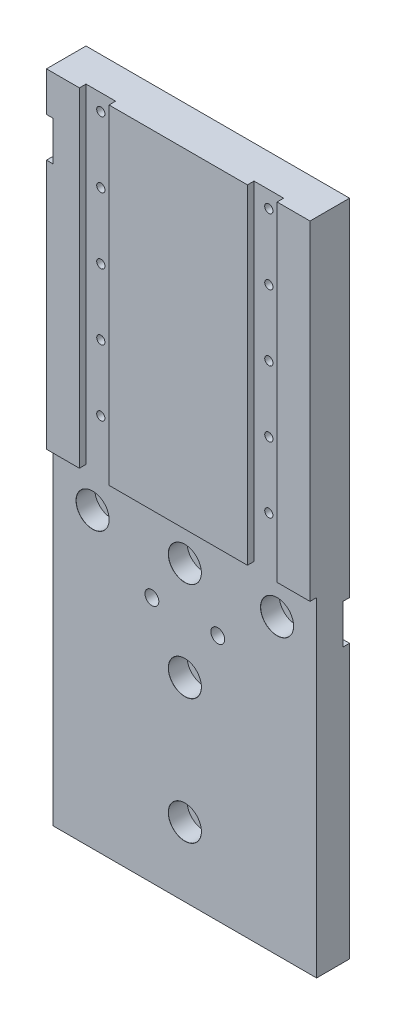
ISO-10303-21;
HEADER;
FILE_DESCRIPTION(('STEP AP214'),'2;1');
FILE_NAME('part.step','',(''),(''),'','','');
FILE_SCHEMA(('AUTOMOTIVE_DESIGN { 1 0 10303 214 1 1 1 1 }'));
ENDSEC;
DATA;
#1=APPLICATION_CONTEXT('core data for automotive mechanical design processes');
#2=APPLICATION_PROTOCOL_DEFINITION('international standard','automotive_design',2000,#1);
#3=PRODUCT_CONTEXT('',#1,'mechanical');
#4=PRODUCT('Part','Part','',(#3));
#5=PRODUCT_RELATED_PRODUCT_CATEGORY('part','',(#4));
#6=PRODUCT_DEFINITION_FORMATION('','',#4);
#7=PRODUCT_DEFINITION_CONTEXT('part definition',#1,'design');
#8=PRODUCT_DEFINITION('design','',#6,#7);
#9=PRODUCT_DEFINITION_SHAPE('','',#8);
#10=(LENGTH_UNIT() NAMED_UNIT(*) SI_UNIT(.MILLI.,.METRE.));
#11=(NAMED_UNIT(*) PLANE_ANGLE_UNIT() SI_UNIT($,.RADIAN.));
#12=(NAMED_UNIT(*) SI_UNIT($,.STERADIAN.) SOLID_ANGLE_UNIT());
#13=UNCERTAINTY_MEASURE_WITH_UNIT(LENGTH_MEASURE(1.E-05),#10,'distance_accuracy_value','');
#14=(GEOMETRIC_REPRESENTATION_CONTEXT(3) GLOBAL_UNCERTAINTY_ASSIGNED_CONTEXT((#13)) GLOBAL_UNIT_ASSIGNED_CONTEXT((#10,
#11,#12)) REPRESENTATION_CONTEXT('',''));
#15=CARTESIAN_POINT('',(0.,0.,0.));
#16=DIRECTION('',(0.,0.,1.));
#17=DIRECTION('',(1.,0.,0.));
#18=AXIS2_PLACEMENT_3D('',#15,#16,#17);
#19=CARTESIAN_POINT('',(-30.,-100.,10.));
#20=DIRECTION('',(0.,0.,-1.));
#21=DIRECTION('',(-1.,0.,0.));
#22=AXIS2_PLACEMENT_3D('',#19,#20,#21);
#23=PLANE('',#22);
#24=CARTESIAN_POINT('',(-28.,-11.,10.));
#25=DIRECTION('',(0.,0.,1.));
#26=DIRECTION('',(1.,0.,0.));
#27=AXIS2_PLACEMENT_3D('',#24,#25,#26);
#28=CIRCLE('',#27,5.025);
#29=CARTESIAN_POINT('',(-22.975,-11.,10.));
#30=VERTEX_POINT('',#29);
#31=EDGE_CURVE('E713',#30,#30,#28,.T.);
#32=ORIENTED_EDGE('',*,*,#31,.F.);
#33=EDGE_LOOP('',(#32));
#34=FACE_BOUND('',#33,.T.);
#35=CARTESIAN_POINT('',(0.,-11.,10.));
#36=DIRECTION('',(0.,0.,1.));
#37=DIRECTION('',(1.,0.,0.));
#38=AXIS2_PLACEMENT_3D('',#35,#36,#37);
#39=CIRCLE('',#38,5.025);
#40=CARTESIAN_POINT('',(5.025,-11.,10.));
#41=VERTEX_POINT('',#40);
#42=EDGE_CURVE('E735',#41,#41,#39,.T.);
#43=ORIENTED_EDGE('',*,*,#42,.F.);
#44=EDGE_LOOP('',(#43));
#45=FACE_BOUND('',#44,.T.);
#46=CARTESIAN_POINT('',(28.,-11.,10.));
#47=DIRECTION('',(0.,0.,1.));
#48=DIRECTION('',(1.,0.,0.));
#49=AXIS2_PLACEMENT_3D('',#46,#47,#48);
#50=CIRCLE('',#49,5.025);
#51=CARTESIAN_POINT('',(33.025,-11.,10.));
#52=VERTEX_POINT('',#51);
#53=EDGE_CURVE('E756',#52,#52,#50,.T.);
#54=ORIENTED_EDGE('',*,*,#53,.F.);
#55=EDGE_LOOP('',(#54));
#56=FACE_BOUND('',#55,.T.);
#57=CARTESIAN_POINT('',(0.,-41.,10.));
#58=DIRECTION('',(0.,0.,1.));
#59=DIRECTION('',(1.,0.,0.));
#60=AXIS2_PLACEMENT_3D('',#57,#58,#59);
#61=CIRCLE('',#60,5.025);
#62=CARTESIAN_POINT('',(5.025,-41.,10.));
#63=VERTEX_POINT('',#62);
#64=EDGE_CURVE('E777',#63,#63,#61,.T.);
#65=ORIENTED_EDGE('',*,*,#64,.F.);
#66=EDGE_LOOP('',(#65));
#67=FACE_BOUND('',#66,.T.);
#68=CARTESIAN_POINT('',(-10.0000000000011,-25.,10.));
#69=DIRECTION('',(0.,0.,1.));
#70=DIRECTION('',(1.,0.,0.));
#71=AXIS2_PLACEMENT_3D('',#68,#69,#70);
#72=CIRCLE('',#71,2.1);
#73=CARTESIAN_POINT('',(-7.90000000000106,-25.,10.));
#74=VERTEX_POINT('',#73);
#75=EDGE_CURVE('E229',#74,#74,#72,.T.);
#76=ORIENTED_EDGE('',*,*,#75,.F.);
#77=EDGE_LOOP('',(#76));
#78=FACE_BOUND('',#77,.T.);
#79=CARTESIAN_POINT('',(9.99999999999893,-25.,10.));
#80=DIRECTION('',(0.,0.,1.));
#81=DIRECTION('',(1.,0.,0.));
#82=AXIS2_PLACEMENT_3D('',#79,#80,#81);
#83=CIRCLE('',#82,2.1);
#84=CARTESIAN_POINT('',(12.0999999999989,-25.,10.));
#85=VERTEX_POINT('',#84);
#86=EDGE_CURVE('E240',#85,#85,#83,.T.);
#87=ORIENTED_EDGE('',*,*,#86,.F.);
#88=EDGE_LOOP('',(#87));
#89=FACE_BOUND('',#88,.T.);
#90=CARTESIAN_POINT('',(-25.500000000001,95.,10.));
#91=DIRECTION('',(0.,0.,1.));
#92=DIRECTION('',(1.,0.,0.));
#93=AXIS2_PLACEMENT_3D('',#90,#91,#92);
#94=CIRCLE('',#93,1.25);
#95=CARTESIAN_POINT('',(-24.250000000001,95.,10.));
#96=VERTEX_POINT('',#95);
#97=EDGE_CURVE('E246',#96,#96,#94,.T.);
#98=ORIENTED_EDGE('',*,*,#97,.F.);
#99=EDGE_LOOP('',(#98));
#100=FACE_BOUND('',#99,.T.);
#101=CARTESIAN_POINT('',(-25.500000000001,75.,10.));
#102=DIRECTION('',(0.,0.,1.));
#103=DIRECTION('',(1.,0.,0.));
#104=AXIS2_PLACEMENT_3D('',#101,#102,#103);
#105=CIRCLE('',#104,1.25);
#106=CARTESIAN_POINT('',(-24.250000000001,75.,10.));
#107=VERTEX_POINT('',#106);
#108=EDGE_CURVE('E252',#107,#107,#105,.T.);
#109=ORIENTED_EDGE('',*,*,#108,.F.);
#110=EDGE_LOOP('',(#109));
#111=FACE_BOUND('',#110,.T.);
#112=CARTESIAN_POINT('',(-25.500000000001,55.,10.));
#113=DIRECTION('',(0.,0.,1.));
#114=DIRECTION('',(1.,0.,0.));
#115=AXIS2_PLACEMENT_3D('',#112,#113,#114);
#116=CIRCLE('',#115,1.25);
#117=CARTESIAN_POINT('',(-24.250000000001,55.,10.));
#118=VERTEX_POINT('',#117);
#119=EDGE_CURVE('E258',#118,#118,#116,.T.);
#120=ORIENTED_EDGE('',*,*,#119,.F.);
#121=EDGE_LOOP('',(#120));
#122=FACE_BOUND('',#121,.T.);
#123=CARTESIAN_POINT('',(-25.500000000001,35.,10.));
#124=DIRECTION('',(0.,0.,1.));
#125=DIRECTION('',(1.,0.,0.));
#126=AXIS2_PLACEMENT_3D('',#123,#124,#125);
#127=CIRCLE('',#126,1.25);
#128=CARTESIAN_POINT('',(-24.250000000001,35.,10.));
#129=VERTEX_POINT('',#128);
#130=EDGE_CURVE('E264',#129,#129,#127,.T.);
#131=ORIENTED_EDGE('',*,*,#130,.F.);
#132=EDGE_LOOP('',(#131));
#133=FACE_BOUND('',#132,.T.);
#134=CARTESIAN_POINT('',(-25.500000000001,15.,10.));
#135=DIRECTION('',(0.,0.,1.));
#136=DIRECTION('',(1.,0.,0.));
#137=AXIS2_PLACEMENT_3D('',#134,#135,#136);
#138=CIRCLE('',#137,1.25);
#139=CARTESIAN_POINT('',(-24.250000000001,15.,10.));
#140=VERTEX_POINT('',#139);
#141=EDGE_CURVE('E270',#140,#140,#138,.T.);
#142=ORIENTED_EDGE('',*,*,#141,.F.);
#143=EDGE_LOOP('',(#142));
#144=FACE_BOUND('',#143,.T.);
#145=CARTESIAN_POINT('',(25.499999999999,15.,10.));
#146=DIRECTION('',(0.,0.,1.));
#147=DIRECTION('',(1.,0.,0.));
#148=AXIS2_PLACEMENT_3D('',#145,#146,#147);
#149=CIRCLE('',#148,1.25);
#150=CARTESIAN_POINT('',(26.749999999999,15.,10.));
#151=VERTEX_POINT('',#150);
#152=EDGE_CURVE('E276',#151,#151,#149,.T.);
#153=ORIENTED_EDGE('',*,*,#152,.F.);
#154=EDGE_LOOP('',(#153));
#155=FACE_BOUND('',#154,.T.);
#156=CARTESIAN_POINT('',(25.499999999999,35.,10.));
#157=DIRECTION('',(0.,0.,1.));
#158=DIRECTION('',(1.,0.,0.));
#159=AXIS2_PLACEMENT_3D('',#156,#157,#158);
#160=CIRCLE('',#159,1.25);
#161=CARTESIAN_POINT('',(26.749999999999,35.,10.));
#162=VERTEX_POINT('',#161);
#163=EDGE_CURVE('E282',#162,#162,#160,.T.);
#164=ORIENTED_EDGE('',*,*,#163,.F.);
#165=EDGE_LOOP('',(#164));
#166=FACE_BOUND('',#165,.T.);
#167=CARTESIAN_POINT('',(25.499999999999,55.,10.));
#168=DIRECTION('',(0.,0.,1.));
#169=DIRECTION('',(1.,0.,0.));
#170=AXIS2_PLACEMENT_3D('',#167,#168,#169);
#171=CIRCLE('',#170,1.25);
#172=CARTESIAN_POINT('',(26.749999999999,55.,10.));
#173=VERTEX_POINT('',#172);
#174=EDGE_CURVE('E288',#173,#173,#171,.T.);
#175=ORIENTED_EDGE('',*,*,#174,.F.);
#176=EDGE_LOOP('',(#175));
#177=FACE_BOUND('',#176,.T.);
#178=CARTESIAN_POINT('',(25.499999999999,75.,10.));
#179=DIRECTION('',(0.,0.,1.));
#180=DIRECTION('',(1.,0.,0.));
#181=AXIS2_PLACEMENT_3D('',#178,#179,#180);
#182=CIRCLE('',#181,1.25);
#183=CARTESIAN_POINT('',(26.749999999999,75.,10.));
#184=VERTEX_POINT('',#183);
#185=EDGE_CURVE('E294',#184,#184,#182,.T.);
#186=ORIENTED_EDGE('',*,*,#185,.F.);
#187=EDGE_LOOP('',(#186));
#188=FACE_BOUND('',#187,.T.);
#189=CARTESIAN_POINT('',(25.499999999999,95.,10.));
#190=DIRECTION('',(0.,0.,1.));
#191=DIRECTION('',(1.,0.,0.));
#192=AXIS2_PLACEMENT_3D('',#189,#190,#191);
#193=CIRCLE('',#192,1.25);
#194=CARTESIAN_POINT('',(26.749999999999,95.,10.));
#195=VERTEX_POINT('',#194);
#196=EDGE_CURVE('E300',#195,#195,#193,.T.);
#197=ORIENTED_EDGE('',*,*,#196,.F.);
#198=EDGE_LOOP('',(#197));
#199=FACE_BOUND('',#198,.T.);
#200=DIRECTION('',(0.,1.,0.));
#201=VECTOR('',#200,1.);
#202=CARTESIAN_POINT('',(-30.,-100.,10.));
#203=LINE('',#202,#201);
#204=CARTESIAN_POINT('',(-30.,0.,10.));
#205=VERTEX_POINT('',#204);
#206=CARTESIAN_POINT('',(-30.,100.,10.));
#207=VERTEX_POINT('',#206);
#208=EDGE_CURVE('E364',#205,#207,#203,.T.);
#209=ORIENTED_EDGE('',*,*,#208,.F.);
#210=DIRECTION('',(1.,0.,0.));
#211=VECTOR('',#210,1.);
#212=CARTESIAN_POINT('',(-40.,0.,10.));
#213=LINE('',#212,#211);
#214=CARTESIAN_POINT('',(-40.,0.,10.));
#215=VERTEX_POINT('',#214);
#216=EDGE_CURVE('E324',#215,#205,#213,.T.);
#217=ORIENTED_EDGE('',*,*,#216,.F.);
#218=DIRECTION('',(0.,1.,0.));
#219=VECTOR('',#218,1.);
#220=CARTESIAN_POINT('',(-40.,-100.,10.));
#221=LINE('',#220,#219);
#222=CARTESIAN_POINT('',(-40.,-100.,10.));
#223=VERTEX_POINT('',#222);
#224=EDGE_CURVE('E307',#223,#215,#221,.T.);
#225=ORIENTED_EDGE('',*,*,#224,.F.);
#226=DIRECTION('',(-1.,0.,0.));
#227=VECTOR('',#226,1.);
#228=CARTESIAN_POINT('',(-30.,-100.,10.));
#229=LINE('',#228,#227);
#230=CARTESIAN_POINT('',(40.,-100.,10.));
#231=VERTEX_POINT('',#230);
#232=EDGE_CURVE('E353',#231,#223,#229,.T.);
#233=ORIENTED_EDGE('',*,*,#232,.F.);
#234=DIRECTION('',(0.,1.,0.));
#235=VECTOR('',#234,1.);
#236=CARTESIAN_POINT('',(40.,-100.,10.));
#237=LINE('',#236,#235);
#238=CARTESIAN_POINT('',(40.,0.,10.));
#239=VERTEX_POINT('',#238);
#240=EDGE_CURVE('E306',#231,#239,#237,.T.);
#241=ORIENTED_EDGE('',*,*,#240,.T.);
#242=CARTESIAN_POINT('',(30.,0.,10.));
#243=VERTEX_POINT('',#242);
#244=EDGE_CURVE('E314',#243,#239,#213,.T.);
#245=ORIENTED_EDGE('',*,*,#244,.F.);
#246=DIRECTION('',(0.,1.,0.));
#247=VECTOR('',#246,1.);
#248=CARTESIAN_POINT('',(30.,-100.,10.));
#249=LINE('',#248,#247);
#250=CARTESIAN_POINT('',(30.,100.,10.));
#251=VERTEX_POINT('',#250);
#252=EDGE_CURVE('E350',#243,#251,#249,.T.);
#253=ORIENTED_EDGE('',*,*,#252,.T.);
#254=DIRECTION('',(-1.,0.,0.));
#255=VECTOR('',#254,1.);
#256=CARTESIAN_POINT('',(30.,100.,10.));
#257=LINE('',#256,#255);
#258=CARTESIAN_POINT('',(21.,100.,10.));
#259=VERTEX_POINT('',#258);
#260=EDGE_CURVE('E338',#251,#259,#257,.T.);
#261=ORIENTED_EDGE('',*,*,#260,.T.);
#262=DIRECTION('',(0.,1.,0.));
#263=VECTOR('',#262,1.);
#264=CARTESIAN_POINT('',(21.,-100.,10.));
#265=LINE('',#264,#263);
#266=CARTESIAN_POINT('',(21.,0.,10.));
#267=VERTEX_POINT('',#266);
#268=EDGE_CURVE('E348',#267,#259,#265,.T.);
#269=ORIENTED_EDGE('',*,*,#268,.F.);
#270=CARTESIAN_POINT('',(-21.,0.,10.));
#271=VERTEX_POINT('',#270);
#272=EDGE_CURVE('E326',#271,#267,#213,.T.);
#273=ORIENTED_EDGE('',*,*,#272,.F.);
#274=DIRECTION('',(0.,1.,0.));
#275=VECTOR('',#274,1.);
#276=CARTESIAN_POINT('',(-21.,-100.,10.));
#277=LINE('',#276,#275);
#278=CARTESIAN_POINT('',(-21.,100.,10.));
#279=VERTEX_POINT('',#278);
#280=EDGE_CURVE('E367',#271,#279,#277,.T.);
#281=ORIENTED_EDGE('',*,*,#280,.T.);
#282=DIRECTION('',(-1.,0.,0.));
#283=VECTOR('',#282,1.);
#284=CARTESIAN_POINT('',(-30.,100.,10.));
#285=LINE('',#284,#283);
#286=EDGE_CURVE('E356',#279,#207,#285,.T.);
#287=ORIENTED_EDGE('',*,*,#286,.T.);
#288=EDGE_LOOP('',(#209,#217,#225,#233,#241,#245,#253,#261,#269,#273,#281,#287));
#289=FACE_BOUND('',#288,.T.);
#290=CARTESIAN_POINT('',(0.,-79.,10.));
#291=DIRECTION('',(0.,0.,1.));
#292=DIRECTION('',(1.,0.,0.));
#293=AXIS2_PLACEMENT_3D('',#290,#291,#292);
#294=CIRCLE('',#293,5.025);
#295=CARTESIAN_POINT('',(5.025,-79.,10.));
#296=VERTEX_POINT('',#295);
#297=EDGE_CURVE('E798',#296,#296,#294,.T.);
#298=ORIENTED_EDGE('',*,*,#297,.F.);
#299=EDGE_LOOP('',(#298));
#300=FACE_BOUND('',#299,.T.);
#301=ADVANCED_FACE('F16',(#34,#45,#56,#67,#78,#89,#100,#111,#122,#133,#144,#155,#166,#177,#188,
#199,#289,#300),#23,.F.);
#302=CARTESIAN_POINT('',(0.,0.,0.));
#303=DIRECTION('',(0.,0.,1.));
#304=DIRECTION('',(1.,0.,0.));
#305=AXIS2_PLACEMENT_3D('',#302,#303,#304);
#306=PLANE('',#305);
#307=CARTESIAN_POINT('',(25.499999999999,95.,0.));
#308=DIRECTION('',(0.,0.,1.));
#309=DIRECTION('',(1.,0.,0.));
#310=AXIS2_PLACEMENT_3D('',#307,#308,#309);
#311=CIRCLE('',#310,1.25);
#312=CARTESIAN_POINT('',(26.749999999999,95.,0.));
#313=VERTEX_POINT('',#312);
#314=EDGE_CURVE('E303',#313,#313,#311,.T.);
#315=ORIENTED_EDGE('',*,*,#314,.T.);
#316=EDGE_LOOP('',(#315));
#317=FACE_BOUND('',#316,.T.);
#318=CARTESIAN_POINT('',(25.499999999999,75.,0.));
#319=DIRECTION('',(0.,0.,1.));
#320=DIRECTION('',(1.,0.,0.));
#321=AXIS2_PLACEMENT_3D('',#318,#319,#320);
#322=CIRCLE('',#321,1.25);
#323=CARTESIAN_POINT('',(26.749999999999,75.,0.));
#324=VERTEX_POINT('',#323);
#325=EDGE_CURVE('E297',#324,#324,#322,.T.);
#326=ORIENTED_EDGE('',*,*,#325,.T.);
#327=EDGE_LOOP('',(#326));
#328=FACE_BOUND('',#327,.T.);
#329=CARTESIAN_POINT('',(25.499999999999,55.,0.));
#330=DIRECTION('',(0.,0.,1.));
#331=DIRECTION('',(1.,0.,0.));
#332=AXIS2_PLACEMENT_3D('',#329,#330,#331);
#333=CIRCLE('',#332,1.25);
#334=CARTESIAN_POINT('',(26.749999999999,55.,0.));
#335=VERTEX_POINT('',#334);
#336=EDGE_CURVE('E291',#335,#335,#333,.T.);
#337=ORIENTED_EDGE('',*,*,#336,.T.);
#338=EDGE_LOOP('',(#337));
#339=FACE_BOUND('',#338,.T.);
#340=CARTESIAN_POINT('',(25.499999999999,35.,0.));
#341=DIRECTION('',(0.,0.,1.));
#342=DIRECTION('',(1.,0.,0.));
#343=AXIS2_PLACEMENT_3D('',#340,#341,#342);
#344=CIRCLE('',#343,1.25);
#345=CARTESIAN_POINT('',(26.749999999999,35.,0.));
#346=VERTEX_POINT('',#345);
#347=EDGE_CURVE('E285',#346,#346,#344,.T.);
#348=ORIENTED_EDGE('',*,*,#347,.T.);
#349=EDGE_LOOP('',(#348));
#350=FACE_BOUND('',#349,.T.);
#351=CARTESIAN_POINT('',(25.499999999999,15.,0.));
#352=DIRECTION('',(0.,0.,1.));
#353=DIRECTION('',(1.,0.,0.));
#354=AXIS2_PLACEMENT_3D('',#351,#352,#353);
#355=CIRCLE('',#354,1.25);
#356=CARTESIAN_POINT('',(26.749999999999,15.,0.));
#357=VERTEX_POINT('',#356);
#358=EDGE_CURVE('E279',#357,#357,#355,.T.);
#359=ORIENTED_EDGE('',*,*,#358,.T.);
#360=EDGE_LOOP('',(#359));
#361=FACE_BOUND('',#360,.T.);
#362=CARTESIAN_POINT('',(-25.500000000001,15.,0.));
#363=DIRECTION('',(0.,0.,1.));
#364=DIRECTION('',(1.,0.,0.));
#365=AXIS2_PLACEMENT_3D('',#362,#363,#364);
#366=CIRCLE('',#365,1.25);
#367=CARTESIAN_POINT('',(-24.250000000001,15.,0.));
#368=VERTEX_POINT('',#367);
#369=EDGE_CURVE('E273',#368,#368,#366,.T.);
#370=ORIENTED_EDGE('',*,*,#369,.T.);
#371=EDGE_LOOP('',(#370));
#372=FACE_BOUND('',#371,.T.);
#373=CARTESIAN_POINT('',(-25.500000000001,35.,0.));
#374=DIRECTION('',(0.,0.,1.));
#375=DIRECTION('',(1.,0.,0.));
#376=AXIS2_PLACEMENT_3D('',#373,#374,#375);
#377=CIRCLE('',#376,1.25);
#378=CARTESIAN_POINT('',(-24.250000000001,35.,0.));
#379=VERTEX_POINT('',#378);
#380=EDGE_CURVE('E267',#379,#379,#377,.T.);
#381=ORIENTED_EDGE('',*,*,#380,.T.);
#382=EDGE_LOOP('',(#381));
#383=FACE_BOUND('',#382,.T.);
#384=CARTESIAN_POINT('',(-25.500000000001,55.,0.));
#385=DIRECTION('',(0.,0.,1.));
#386=DIRECTION('',(1.,0.,0.));
#387=AXIS2_PLACEMENT_3D('',#384,#385,#386);
#388=CIRCLE('',#387,1.25);
#389=CARTESIAN_POINT('',(-24.250000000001,55.,0.));
#390=VERTEX_POINT('',#389);
#391=EDGE_CURVE('E261',#390,#390,#388,.T.);
#392=ORIENTED_EDGE('',*,*,#391,.T.);
#393=EDGE_LOOP('',(#392));
#394=FACE_BOUND('',#393,.T.);
#395=CARTESIAN_POINT('',(-25.500000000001,75.,0.));
#396=DIRECTION('',(0.,0.,1.));
#397=DIRECTION('',(1.,0.,0.));
#398=AXIS2_PLACEMENT_3D('',#395,#396,#397);
#399=CIRCLE('',#398,1.25);
#400=CARTESIAN_POINT('',(-24.250000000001,75.,0.));
#401=VERTEX_POINT('',#400);
#402=EDGE_CURVE('E255',#401,#401,#399,.T.);
#403=ORIENTED_EDGE('',*,*,#402,.T.);
#404=EDGE_LOOP('',(#403));
#405=FACE_BOUND('',#404,.T.);
#406=CARTESIAN_POINT('',(-25.500000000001,95.,0.));
#407=DIRECTION('',(0.,0.,1.));
#408=DIRECTION('',(1.,0.,0.));
#409=AXIS2_PLACEMENT_3D('',#406,#407,#408);
#410=CIRCLE('',#409,1.25);
#411=CARTESIAN_POINT('',(-24.250000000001,95.,0.));
#412=VERTEX_POINT('',#411);
#413=EDGE_CURVE('E249',#412,#412,#410,.T.);
#414=ORIENTED_EDGE('',*,*,#413,.T.);
#415=EDGE_LOOP('',(#414));
#416=FACE_BOUND('',#415,.T.);
#417=DIRECTION('',(0.,1.,0.));
#418=VECTOR('',#417,1.);
#419=CARTESIAN_POINT('',(40.,100.,0.));
#420=LINE('',#419,#418);
#421=CARTESIAN_POINT('',(40.,-5.,0.));
#422=VERTEX_POINT('',#421);
#423=CARTESIAN_POINT('',(40.,100.,0.));
#424=VERTEX_POINT('',#423);
#425=EDGE_CURVE('E366',#422,#424,#420,.T.);
#426=ORIENTED_EDGE('',*,*,#425,.F.);
#427=DIRECTION('',(-1.,0.,0.));
#428=VECTOR('',#427,1.);
#429=CARTESIAN_POINT('',(40.,-5.,0.));
#430=LINE('',#429,#428);
#431=CARTESIAN_POINT('',(-40.,-5.,0.));
#432=VERTEX_POINT('',#431);
#433=EDGE_CURVE('E199',#422,#432,#430,.T.);
#434=ORIENTED_EDGE('',*,*,#433,.T.);
#435=DIRECTION('',(0.,-1.,0.));
#436=VECTOR('',#435,1.);
#437=CARTESIAN_POINT('',(-40.,100.,0.));
#438=LINE('',#437,#436);
#439=CARTESIAN_POINT('',(-40.,76.,0.));
#440=VERTEX_POINT('',#439);
#441=EDGE_CURVE('E392',#440,#432,#438,.T.);
#442=ORIENTED_EDGE('',*,*,#441,.F.);
#443=DIRECTION('',(1.,0.,0.));
#444=VECTOR('',#443,1.);
#445=CARTESIAN_POINT('',(-40.,76.,0.));
#446=LINE('',#445,#444);
#447=CARTESIAN_POINT('',(-38.,76.,0.));
#448=VERTEX_POINT('',#447);
#449=EDGE_CURVE('E211',#440,#448,#446,.T.);
#450=ORIENTED_EDGE('',*,*,#449,.T.);
#451=DIRECTION('',(0.,1.,0.));
#452=VECTOR('',#451,1.);
#453=CARTESIAN_POINT('',(-38.,88.,0.));
#454=LINE('',#453,#452);
#455=CARTESIAN_POINT('',(-38.,88.,0.));
#456=VERTEX_POINT('',#455);
#457=EDGE_CURVE('E39',#448,#456,#454,.T.);
#458=ORIENTED_EDGE('',*,*,#457,.T.);
#459=DIRECTION('',(-1.,0.,0.));
#460=VECTOR('',#459,1.);
#461=CARTESIAN_POINT('',(-40.,88.,0.));
#462=LINE('',#461,#460);
#463=CARTESIAN_POINT('',(-40.,88.,0.));
#464=VERTEX_POINT('',#463);
#465=EDGE_CURVE('E216',#456,#464,#462,.T.);
#466=ORIENTED_EDGE('',*,*,#465,.T.);
#467=CARTESIAN_POINT('',(-40.,100.,0.));
#468=VERTEX_POINT('',#467);
#469=EDGE_CURVE('E389',#468,#464,#438,.T.);
#470=ORIENTED_EDGE('',*,*,#469,.F.);
#471=DIRECTION('',(-1.,0.,0.));
#472=VECTOR('',#471,1.);
#473=CARTESIAN_POINT('',(-40.,100.,0.));
#474=LINE('',#473,#472);
#475=EDGE_CURVE('E386',#424,#468,#474,.T.);
#476=ORIENTED_EDGE('',*,*,#475,.F.);
#477=EDGE_LOOP('',(#426,#434,#442,#450,#458,#466,#470,#476));
#478=FACE_BOUND('',#477,.T.);
#479=ADVANCED_FACE('F415',(#317,#328,#339,#350,#361,#372,#383,#394,#405,#416,#478),#306,.F.);
#480=CARTESIAN_POINT('',(-40.,100.,12.));
#481=DIRECTION('',(1.,0.,0.));
#482=DIRECTION('',(0.,1.,0.));
#483=AXIS2_PLACEMENT_3D('',#480,#481,#482);
#484=PLANE('',#483);
#485=ORIENTED_EDGE('',*,*,#469,.T.);
#486=DIRECTION('',(0.,0.,1.));
#487=VECTOR('',#486,1.);
#488=CARTESIAN_POINT('',(-40.,88.,0.));
#489=LINE('',#488,#487);
#490=CARTESIAN_POINT('',(-40.,88.,12.));
#491=VERTEX_POINT('',#490);
#492=EDGE_CURVE('E226',#464,#491,#489,.T.);
#493=ORIENTED_EDGE('',*,*,#492,.T.);
#494=DIRECTION('',(0.,-1.,0.));
#495=VECTOR('',#494,1.);
#496=CARTESIAN_POINT('',(-40.,100.,12.));
#497=LINE('',#496,#495);
#498=CARTESIAN_POINT('',(-40.,100.,12.));
#499=VERTEX_POINT('',#498);
#500=EDGE_CURVE('E381',#499,#491,#497,.T.);
#501=ORIENTED_EDGE('',*,*,#500,.F.);
#502=DIRECTION('',(0.,0.,-1.));
#503=VECTOR('',#502,1.);
#504=CARTESIAN_POINT('',(-40.,100.,12.));
#505=LINE('',#504,#503);
#506=EDGE_CURVE('E399',#499,#468,#505,.T.);
#507=ORIENTED_EDGE('',*,*,#506,.T.);
#508=EDGE_LOOP('',(#485,#493,#501,#507));
#509=FACE_BOUND('',#508,.T.);
#510=ADVANCED_FACE('F418',(#509),#484,.F.);
#511=CARTESIAN_POINT('',(0.,0.,12.));
#512=DIRECTION('',(0.,0.,1.));
#513=DIRECTION('',(1.,0.,0.));
#514=AXIS2_PLACEMENT_3D('',#511,#512,#513);
#515=PLANE('',#514);
#516=DIRECTION('',(1.,0.,0.));
#517=VECTOR('',#516,1.);
#518=CARTESIAN_POINT('',(-40.,0.,12.));
#519=LINE('',#518,#517);
#520=CARTESIAN_POINT('',(-21.,0.,12.));
#521=VERTEX_POINT('',#520);
#522=CARTESIAN_POINT('',(21.,0.,12.));
#523=VERTEX_POINT('',#522);
#524=EDGE_CURVE('E322',#521,#523,#519,.T.);
#525=ORIENTED_EDGE('',*,*,#524,.T.);
#526=DIRECTION('',(0.,1.,0.));
#527=VECTOR('',#526,1.);
#528=CARTESIAN_POINT('',(21.,-100.,12.));
#529=LINE('',#528,#527);
#530=CARTESIAN_POINT('',(21.,100.,12.));
#531=VERTEX_POINT('',#530);
#532=EDGE_CURVE('E345',#523,#531,#529,.T.);
#533=ORIENTED_EDGE('',*,*,#532,.T.);
#534=DIRECTION('',(-1.,0.,0.));
#535=VECTOR('',#534,1.);
#536=CARTESIAN_POINT('',(-40.,100.,12.));
#537=LINE('',#536,#535);
#538=CARTESIAN_POINT('',(-21.,100.,12.));
#539=VERTEX_POINT('',#538);
#540=EDGE_CURVE('E380',#531,#539,#537,.T.);
#541=ORIENTED_EDGE('',*,*,#540,.T.);
#542=DIRECTION('',(0.,1.,0.));
#543=VECTOR('',#542,1.);
#544=CARTESIAN_POINT('',(-21.,-100.,12.));
#545=LINE('',#544,#543);
#546=EDGE_CURVE('E369',#521,#539,#545,.T.);
#547=ORIENTED_EDGE('',*,*,#546,.F.);
#548=EDGE_LOOP('',(#525,#533,#541,#547));
#549=FACE_BOUND('',#548,.T.);
#550=ADVANCED_FACE('F429',(#549),#515,.T.);
#551=DIRECTION('',(-1.,0.,0.));
#552=VECTOR('',#551,1.);
#553=CARTESIAN_POINT('',(-40.,88.,12.));
#554=LINE('',#553,#552);
#555=CARTESIAN_POINT('',(-38.,88.,12.));
#556=VERTEX_POINT('',#555);
#557=EDGE_CURVE('E214',#556,#491,#554,.T.);
#558=ORIENTED_EDGE('',*,*,#557,.F.);
#559=DIRECTION('',(0.,1.,0.));
#560=VECTOR('',#559,1.);
#561=CARTESIAN_POINT('',(-38.,88.,12.));
#562=LINE('',#561,#560);
#563=CARTESIAN_POINT('',(-38.,76.,12.));
#564=VERTEX_POINT('',#563);
#565=EDGE_CURVE('E222',#564,#556,#562,.T.);
#566=ORIENTED_EDGE('',*,*,#565,.F.);
#567=DIRECTION('',(1.,0.,0.));
#568=VECTOR('',#567,1.);
#569=CARTESIAN_POINT('',(-40.,76.,12.));
#570=LINE('',#569,#568);
#571=CARTESIAN_POINT('',(-40.,76.,12.));
#572=VERTEX_POINT('',#571);
#573=EDGE_CURVE('E210',#572,#564,#570,.T.);
#574=ORIENTED_EDGE('',*,*,#573,.F.);
#575=CARTESIAN_POINT('',(-40.,0.,12.));
#576=VERTEX_POINT('',#575);
#577=EDGE_CURVE('E379',#572,#576,#497,.T.);
#578=ORIENTED_EDGE('',*,*,#577,.T.);
#579=CARTESIAN_POINT('',(-30.,0.,12.));
#580=VERTEX_POINT('',#579);
#581=EDGE_CURVE('E318',#576,#580,#519,.T.);
#582=ORIENTED_EDGE('',*,*,#581,.T.);
#583=DIRECTION('',(0.,1.,0.));
#584=VECTOR('',#583,1.);
#585=CARTESIAN_POINT('',(-30.,-100.,12.));
#586=LINE('',#585,#584);
#587=CARTESIAN_POINT('',(-30.,100.,12.));
#588=VERTEX_POINT('',#587);
#589=EDGE_CURVE('E355',#580,#588,#586,.T.);
#590=ORIENTED_EDGE('',*,*,#589,.T.);
#591=EDGE_CURVE('E374',#588,#499,#537,.T.);
#592=ORIENTED_EDGE('',*,*,#591,.T.);
#593=ORIENTED_EDGE('',*,*,#500,.T.);
#594=EDGE_LOOP('',(#558,#566,#574,#578,#582,#590,#592,#593));
#595=FACE_BOUND('',#594,.T.);
#596=ADVANCED_FACE('F472',(#595),#515,.T.);
#597=CARTESIAN_POINT('',(40.,100.,12.));
#598=DIRECTION('',(-1.,0.,0.));
#599=DIRECTION('',(0.,-1.,0.));
#600=AXIS2_PLACEMENT_3D('',#597,#598,#599);
#601=PLANE('',#600);
#602=DIRECTION('',(0.,1.,0.));
#603=VECTOR('',#602,1.);
#604=CARTESIAN_POINT('',(40.,-17.,2.));
#605=LINE('',#604,#603);
#606=CARTESIAN_POINT('',(40.,-17.,2.));
#607=VERTEX_POINT('',#606);
#608=CARTESIAN_POINT('',(40.,-5.,2.));
#609=VERTEX_POINT('',#608);
#610=EDGE_CURVE('E178',#607,#609,#605,.T.);
#611=ORIENTED_EDGE('',*,*,#610,.T.);
#612=DIRECTION('',(0.,0.,-1.));
#613=VECTOR('',#612,1.);
#614=CARTESIAN_POINT('',(40.,-5.,0.));
#615=LINE('',#614,#613);
#616=EDGE_CURVE('E183',#609,#422,#615,.T.);
#617=ORIENTED_EDGE('',*,*,#616,.T.);
#618=ORIENTED_EDGE('',*,*,#425,.T.);
#619=DIRECTION('',(0.,0.,-1.));
#620=VECTOR('',#619,1.);
#621=CARTESIAN_POINT('',(40.,100.,12.));
#622=LINE('',#621,#620);
#623=CARTESIAN_POINT('',(40.,100.,12.));
#624=VERTEX_POINT('',#623);
#625=EDGE_CURVE('E24',#624,#424,#622,.T.);
#626=ORIENTED_EDGE('',*,*,#625,.F.);
#627=DIRECTION('',(0.,1.,0.));
#628=VECTOR('',#627,1.);
#629=CARTESIAN_POINT('',(40.,100.,12.));
#630=LINE('',#629,#628);
#631=CARTESIAN_POINT('',(40.,0.,12.));
#632=VERTEX_POINT('',#631);
#633=EDGE_CURVE('E372',#632,#624,#630,.T.);
#634=ORIENTED_EDGE('',*,*,#633,.F.);
#635=DIRECTION('',(0.,0.,1.));
#636=VECTOR('',#635,1.);
#637=CARTESIAN_POINT('',(40.,0.,12.));
#638=LINE('',#637,#636);
#639=EDGE_CURVE('E311',#239,#632,#638,.T.);
#640=ORIENTED_EDGE('',*,*,#639,.F.);
#641=ORIENTED_EDGE('',*,*,#240,.F.);
#642=DIRECTION('',(0.,0.,-1.));
#643=VECTOR('',#642,1.);
#644=CARTESIAN_POINT('',(40.,-100.,12.));
#645=LINE('',#644,#643);
#646=CARTESIAN_POINT('',(40.,-100.,0.));
#647=VERTEX_POINT('',#646);
#648=EDGE_CURVE('E384',#231,#647,#645,.T.);
#649=ORIENTED_EDGE('',*,*,#648,.T.);
#650=CARTESIAN_POINT('',(40.,-17.,0.));
#651=VERTEX_POINT('',#650);
#652=EDGE_CURVE('E187',#647,#651,#420,.T.);
#653=ORIENTED_EDGE('',*,*,#652,.T.);
#654=DIRECTION('',(0.,0.,1.));
#655=VECTOR('',#654,1.);
#656=CARTESIAN_POINT('',(40.,-17.,0.));
#657=LINE('',#656,#655);
#658=EDGE_CURVE('E31',#651,#607,#657,.T.);
#659=ORIENTED_EDGE('',*,*,#658,.T.);
#660=EDGE_LOOP('',(#611,#617,#618,#626,#634,#640,#641,#649,#653,#659));
#661=FACE_BOUND('',#660,.T.);
#662=ADVANCED_FACE('F18',(#661),#601,.F.);
#663=CARTESIAN_POINT('',(-40.,100.,12.));
#664=DIRECTION('',(0.,-1.,0.));
#665=DIRECTION('',(0.,0.,-1.));
#666=AXIS2_PLACEMENT_3D('',#663,#664,#665);
#667=PLANE('',#666);
#668=ORIENTED_EDGE('',*,*,#540,.F.);
#669=DIRECTION('',(0.,0.,1.));
#670=VECTOR('',#669,1.);
#671=CARTESIAN_POINT('',(21.,100.,12.));
#672=LINE('',#671,#670);
#673=EDGE_CURVE('E341',#259,#531,#672,.T.);
#674=ORIENTED_EDGE('',*,*,#673,.F.);
#675=ORIENTED_EDGE('',*,*,#260,.F.);
#676=DIRECTION('',(0.,0.,-1.));
#677=VECTOR('',#676,1.);
#678=CARTESIAN_POINT('',(30.,100.,12.));
#679=LINE('',#678,#677);
#680=CARTESIAN_POINT('',(30.,100.,12.));
#681=VERTEX_POINT('',#680);
#682=EDGE_CURVE('E335',#681,#251,#679,.T.);
#683=ORIENTED_EDGE('',*,*,#682,.F.);
#684=EDGE_CURVE('E376',#624,#681,#537,.T.);
#685=ORIENTED_EDGE('',*,*,#684,.F.);
#686=ORIENTED_EDGE('',*,*,#625,.T.);
#687=ORIENTED_EDGE('',*,*,#475,.T.);
#688=ORIENTED_EDGE('',*,*,#506,.F.);
#689=ORIENTED_EDGE('',*,*,#591,.F.);
#690=DIRECTION('',(0.,0.,1.));
#691=VECTOR('',#690,1.);
#692=CARTESIAN_POINT('',(-30.,100.,12.));
#693=LINE('',#692,#691);
#694=EDGE_CURVE('E347',#207,#588,#693,.T.);
#695=ORIENTED_EDGE('',*,*,#694,.F.);
#696=ORIENTED_EDGE('',*,*,#286,.F.);
#697=DIRECTION('',(0.,0.,-1.));
#698=VECTOR('',#697,1.);
#699=CARTESIAN_POINT('',(-21.,100.,12.));
#700=LINE('',#699,#698);
#701=EDGE_CURVE('E359',#539,#279,#700,.T.);
#702=ORIENTED_EDGE('',*,*,#701,.F.);
#703=EDGE_LOOP('',(#668,#674,#675,#683,#685,#686,#687,#688,#689,#695,#696,#702));
#704=FACE_BOUND('',#703,.T.);
#705=ADVANCED_FACE('F406',(#704),#667,.F.);
#706=ORIENTED_EDGE('',*,*,#441,.T.);
#707=DIRECTION('',(0.,0.,-1.));
#708=VECTOR('',#707,1.);
#709=CARTESIAN_POINT('',(-40.,-5.,0.));
#710=LINE('',#709,#708);
#711=CARTESIAN_POINT('',(-40.,-5.,2.));
#712=VERTEX_POINT('',#711);
#713=EDGE_CURVE('E188',#712,#432,#710,.T.);
#714=ORIENTED_EDGE('',*,*,#713,.F.);
#715=DIRECTION('',(0.,1.,0.));
#716=VECTOR('',#715,1.);
#717=CARTESIAN_POINT('',(-40.,-17.,2.));
#718=LINE('',#717,#716);
#719=CARTESIAN_POINT('',(-40.,-17.,2.));
#720=VERTEX_POINT('',#719);
#721=EDGE_CURVE('E190',#720,#712,#718,.T.);
#722=ORIENTED_EDGE('',*,*,#721,.F.);
#723=DIRECTION('',(0.,0.,1.));
#724=VECTOR('',#723,1.);
#725=CARTESIAN_POINT('',(-40.,-17.,0.));
#726=LINE('',#725,#724);
#727=CARTESIAN_POINT('',(-40.,-17.,0.));
#728=VERTEX_POINT('',#727);
#729=EDGE_CURVE('E170',#728,#720,#726,.T.);
#730=ORIENTED_EDGE('',*,*,#729,.F.);
#731=CARTESIAN_POINT('',(-40.,-100.,0.));
#732=VERTEX_POINT('',#731);
#733=EDGE_CURVE('E388',#728,#732,#438,.T.);
#734=ORIENTED_EDGE('',*,*,#733,.T.);
#735=DIRECTION('',(0.,0.,-1.));
#736=VECTOR('',#735,1.);
#737=CARTESIAN_POINT('',(-40.,-100.,12.));
#738=LINE('',#737,#736);
#739=EDGE_CURVE('E396',#223,#732,#738,.T.);
#740=ORIENTED_EDGE('',*,*,#739,.F.);
#741=ORIENTED_EDGE('',*,*,#224,.T.);
#742=DIRECTION('',(0.,0.,1.));
#743=VECTOR('',#742,1.);
#744=CARTESIAN_POINT('',(-40.,0.,12.));
#745=LINE('',#744,#743);
#746=EDGE_CURVE('E310',#215,#576,#745,.T.);
#747=ORIENTED_EDGE('',*,*,#746,.T.);
#748=ORIENTED_EDGE('',*,*,#577,.F.);
#749=DIRECTION('',(0.,0.,1.));
#750=VECTOR('',#749,1.);
#751=CARTESIAN_POINT('',(-40.,76.,0.));
#752=LINE('',#751,#750);
#753=EDGE_CURVE('E219',#440,#572,#752,.T.);
#754=ORIENTED_EDGE('',*,*,#753,.F.);
#755=EDGE_LOOP('',(#706,#714,#722,#730,#734,#740,#741,#747,#748,#754));
#756=FACE_BOUND('',#755,.T.);
#757=ADVANCED_FACE('F459',(#756),#484,.F.);
#758=CARTESIAN_POINT('',(-40.,-100.,12.));
#759=DIRECTION('',(0.,1.,0.));
#760=DIRECTION('',(0.,0.,1.));
#761=AXIS2_PLACEMENT_3D('',#758,#759,#760);
#762=PLANE('',#761);
#763=ORIENTED_EDGE('',*,*,#648,.F.);
#764=ORIENTED_EDGE('',*,*,#232,.T.);
#765=ORIENTED_EDGE('',*,*,#739,.T.);
#766=DIRECTION('',(1.,0.,0.));
#767=VECTOR('',#766,1.);
#768=CARTESIAN_POINT('',(-40.,-100.,0.));
#769=LINE('',#768,#767);
#770=EDGE_CURVE('E375',#732,#647,#769,.T.);
#771=ORIENTED_EDGE('',*,*,#770,.T.);
#772=EDGE_LOOP('',(#763,#764,#765,#771));
#773=FACE_BOUND('',#772,.T.);
#774=ADVANCED_FACE('F451',(#773),#762,.F.);
#775=CARTESIAN_POINT('',(30.,0.,12.));
#776=VERTEX_POINT('',#775);
#777=EDGE_CURVE('E323',#776,#632,#519,.T.);
#778=ORIENTED_EDGE('',*,*,#777,.T.);
#779=ORIENTED_EDGE('',*,*,#633,.T.);
#780=ORIENTED_EDGE('',*,*,#684,.T.);
#781=DIRECTION('',(0.,1.,0.));
#782=VECTOR('',#781,1.);
#783=CARTESIAN_POINT('',(30.,-100.,12.));
#784=LINE('',#783,#782);
#785=EDGE_CURVE('E344',#776,#681,#784,.T.);
#786=ORIENTED_EDGE('',*,*,#785,.F.);
#787=EDGE_LOOP('',(#778,#779,#780,#786));
#788=FACE_BOUND('',#787,.T.);
#789=ADVANCED_FACE('F489',(#788),#515,.T.);
#790=CARTESIAN_POINT('',(0.,-41.,0.));
#791=DIRECTION('',(0.,0.,1.));
#792=DIRECTION('',(1.,0.,0.));
#793=AXIS2_PLACEMENT_3D('',#790,#791,#792);
#794=CIRCLE('',#793,2.775);
#795=CARTESIAN_POINT('',(2.775,-41.,0.));
#796=VERTEX_POINT('',#795);
#797=EDGE_CURVE('E774',#796,#796,#794,.T.);
#798=ORIENTED_EDGE('',*,*,#797,.T.);
#799=EDGE_LOOP('',(#798));
#800=FACE_BOUND('',#799,.T.);
#801=CARTESIAN_POINT('',(0.,-79.,0.));
#802=DIRECTION('',(0.,0.,1.));
#803=DIRECTION('',(1.,0.,0.));
#804=AXIS2_PLACEMENT_3D('',#801,#802,#803);
#805=CIRCLE('',#804,2.775);
#806=CARTESIAN_POINT('',(2.775,-79.,0.));
#807=VERTEX_POINT('',#806);
#808=EDGE_CURVE('E795',#807,#807,#805,.T.);
#809=ORIENTED_EDGE('',*,*,#808,.T.);
#810=EDGE_LOOP('',(#809));
#811=FACE_BOUND('',#810,.T.);
#812=CARTESIAN_POINT('',(-10.0000000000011,-25.,0.));
#813=DIRECTION('',(0.,0.,1.));
#814=DIRECTION('',(1.,0.,0.));
#815=AXIS2_PLACEMENT_3D('',#812,#813,#814);
#816=CIRCLE('',#815,2.1);
#817=CARTESIAN_POINT('',(-7.90000000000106,-25.,0.));
#818=VERTEX_POINT('',#817);
#819=EDGE_CURVE('E237',#818,#818,#816,.T.);
#820=ORIENTED_EDGE('',*,*,#819,.T.);
#821=EDGE_LOOP('',(#820));
#822=FACE_BOUND('',#821,.T.);
#823=CARTESIAN_POINT('',(9.99999999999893,-25.,0.));
#824=DIRECTION('',(0.,0.,1.));
#825=DIRECTION('',(1.,0.,0.));
#826=AXIS2_PLACEMENT_3D('',#823,#824,#825);
#827=CIRCLE('',#826,2.1);
#828=CARTESIAN_POINT('',(12.0999999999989,-25.,0.));
#829=VERTEX_POINT('',#828);
#830=EDGE_CURVE('E243',#829,#829,#827,.T.);
#831=ORIENTED_EDGE('',*,*,#830,.T.);
#832=EDGE_LOOP('',(#831));
#833=FACE_BOUND('',#832,.T.);
#834=ORIENTED_EDGE('',*,*,#733,.F.);
#835=DIRECTION('',(-1.,0.,0.));
#836=VECTOR('',#835,1.);
#837=CARTESIAN_POINT('',(40.,-17.,0.));
#838=LINE('',#837,#836);
#839=EDGE_CURVE('E175',#651,#728,#838,.T.);
#840=ORIENTED_EDGE('',*,*,#839,.F.);
#841=ORIENTED_EDGE('',*,*,#652,.F.);
#842=ORIENTED_EDGE('',*,*,#770,.F.);
#843=EDGE_LOOP('',(#834,#840,#841,#842));
#844=FACE_BOUND('',#843,.T.);
#845=ADVANCED_FACE('F456',(#800,#811,#822,#833,#844),#306,.F.);
#846=CARTESIAN_POINT('',(-30.,-100.,12.));
#847=DIRECTION('',(-1.,0.,0.));
#848=DIRECTION('',(0.,0.,1.));
#849=AXIS2_PLACEMENT_3D('',#846,#847,#848);
#850=PLANE('',#849);
#851=ORIENTED_EDGE('',*,*,#589,.F.);
#852=DIRECTION('',(0.,0.,-1.));
#853=VECTOR('',#852,1.);
#854=CARTESIAN_POINT('',(-30.,0.,12.));
#855=LINE('',#854,#853);
#856=EDGE_CURVE('E332',#580,#205,#855,.T.);
#857=ORIENTED_EDGE('',*,*,#856,.T.);
#858=ORIENTED_EDGE('',*,*,#208,.T.);
#859=ORIENTED_EDGE('',*,*,#694,.T.);
#860=EDGE_LOOP('',(#851,#857,#858,#859));
#861=FACE_BOUND('',#860,.T.);
#862=ADVANCED_FACE('F478',(#861),#850,.F.);
#863=CARTESIAN_POINT('',(-21.,-100.,12.));
#864=DIRECTION('',(1.,0.,0.));
#865=DIRECTION('',(0.,0.,-1.));
#866=AXIS2_PLACEMENT_3D('',#863,#864,#865);
#867=PLANE('',#866);
#868=ORIENTED_EDGE('',*,*,#280,.F.);
#869=DIRECTION('',(0.,0.,1.));
#870=VECTOR('',#869,1.);
#871=CARTESIAN_POINT('',(-21.,0.,12.));
#872=LINE('',#871,#870);
#873=EDGE_CURVE('E329',#271,#521,#872,.T.);
#874=ORIENTED_EDGE('',*,*,#873,.T.);
#875=ORIENTED_EDGE('',*,*,#546,.T.);
#876=ORIENTED_EDGE('',*,*,#701,.T.);
#877=EDGE_LOOP('',(#868,#874,#875,#876));
#878=FACE_BOUND('',#877,.T.);
#879=ADVANCED_FACE('F434',(#878),#867,.F.);
#880=CARTESIAN_POINT('',(21.,-100.,12.));
#881=DIRECTION('',(-1.,0.,0.));
#882=DIRECTION('',(0.,0.,1.));
#883=AXIS2_PLACEMENT_3D('',#880,#881,#882);
#884=PLANE('',#883);
#885=ORIENTED_EDGE('',*,*,#532,.F.);
#886=DIRECTION('',(0.,0.,-1.));
#887=VECTOR('',#886,1.);
#888=CARTESIAN_POINT('',(21.,0.,12.));
#889=LINE('',#888,#887);
#890=EDGE_CURVE('E321',#523,#267,#889,.T.);
#891=ORIENTED_EDGE('',*,*,#890,.T.);
#892=ORIENTED_EDGE('',*,*,#268,.T.);
#893=ORIENTED_EDGE('',*,*,#673,.T.);
#894=EDGE_LOOP('',(#885,#891,#892,#893));
#895=FACE_BOUND('',#894,.T.);
#896=ADVANCED_FACE('F487',(#895),#884,.F.);
#897=CARTESIAN_POINT('',(30.,-100.,12.));
#898=DIRECTION('',(1.,0.,0.));
#899=DIRECTION('',(0.,0.,-1.));
#900=AXIS2_PLACEMENT_3D('',#897,#898,#899);
#901=PLANE('',#900);
#902=ORIENTED_EDGE('',*,*,#252,.F.);
#903=DIRECTION('',(0.,0.,1.));
#904=VECTOR('',#903,1.);
#905=CARTESIAN_POINT('',(30.,0.,12.));
#906=LINE('',#905,#904);
#907=EDGE_CURVE('E11',#243,#776,#906,.T.);
#908=ORIENTED_EDGE('',*,*,#907,.T.);
#909=ORIENTED_EDGE('',*,*,#785,.T.);
#910=ORIENTED_EDGE('',*,*,#682,.T.);
#911=EDGE_LOOP('',(#902,#908,#909,#910));
#912=FACE_BOUND('',#911,.T.);
#913=ADVANCED_FACE('F504',(#912),#901,.F.);
#914=CARTESIAN_POINT('',(-40.,0.,12.));
#915=DIRECTION('',(0.,1.,0.));
#916=DIRECTION('',(-1.,0.,0.));
#917=AXIS2_PLACEMENT_3D('',#914,#915,#916);
#918=PLANE('',#917);
#919=ORIENTED_EDGE('',*,*,#244,.T.);
#920=ORIENTED_EDGE('',*,*,#639,.T.);
#921=ORIENTED_EDGE('',*,*,#777,.F.);
#922=ORIENTED_EDGE('',*,*,#907,.F.);
#923=EDGE_LOOP('',(#919,#920,#921,#922));
#924=FACE_BOUND('',#923,.T.);
#925=ADVANCED_FACE('F444',(#924),#918,.F.);
#926=ORIENTED_EDGE('',*,*,#272,.T.);
#927=ORIENTED_EDGE('',*,*,#890,.F.);
#928=ORIENTED_EDGE('',*,*,#524,.F.);
#929=ORIENTED_EDGE('',*,*,#873,.F.);
#930=EDGE_LOOP('',(#926,#927,#928,#929));
#931=FACE_BOUND('',#930,.T.);
#932=ADVANCED_FACE('F437',(#931),#918,.F.);
#933=ORIENTED_EDGE('',*,*,#581,.F.);
#934=ORIENTED_EDGE('',*,*,#746,.F.);
#935=ORIENTED_EDGE('',*,*,#216,.T.);
#936=ORIENTED_EDGE('',*,*,#856,.F.);
#937=EDGE_LOOP('',(#933,#934,#935,#936));
#938=FACE_BOUND('',#937,.T.);
#939=ADVANCED_FACE('F476',(#938),#918,.F.);
#940=CARTESIAN_POINT('',(25.499999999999,95.,10.));
#941=DIRECTION('',(0.,0.,1.));
#942=DIRECTION('',(1.,0.,0.));
#943=AXIS2_PLACEMENT_3D('',#940,#941,#942);
#944=CYLINDRICAL_SURFACE('',#943,1.25);
#945=ORIENTED_EDGE('',*,*,#314,.F.);
#946=EDGE_LOOP('',(#945));
#947=FACE_BOUND('',#946,.T.);
#948=ORIENTED_EDGE('',*,*,#196,.T.);
#949=EDGE_LOOP('',(#948));
#950=FACE_BOUND('',#949,.T.);
#951=ADVANCED_FACE('F513',(#947,#950),#944,.F.);
#952=CARTESIAN_POINT('',(25.499999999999,75.,10.));
#953=DIRECTION('',(0.,0.,1.));
#954=DIRECTION('',(1.,0.,0.));
#955=AXIS2_PLACEMENT_3D('',#952,#953,#954);
#956=CYLINDRICAL_SURFACE('',#955,1.25);
#957=ORIENTED_EDGE('',*,*,#325,.F.);
#958=EDGE_LOOP('',(#957));
#959=FACE_BOUND('',#958,.T.);
#960=ORIENTED_EDGE('',*,*,#185,.T.);
#961=EDGE_LOOP('',(#960));
#962=FACE_BOUND('',#961,.T.);
#963=ADVANCED_FACE('F516',(#959,#962),#956,.F.);
#964=CARTESIAN_POINT('',(25.499999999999,55.,10.));
#965=DIRECTION('',(0.,0.,1.));
#966=DIRECTION('',(1.,0.,0.));
#967=AXIS2_PLACEMENT_3D('',#964,#965,#966);
#968=CYLINDRICAL_SURFACE('',#967,1.25);
#969=ORIENTED_EDGE('',*,*,#336,.F.);
#970=EDGE_LOOP('',(#969));
#971=FACE_BOUND('',#970,.T.);
#972=ORIENTED_EDGE('',*,*,#174,.T.);
#973=EDGE_LOOP('',(#972));
#974=FACE_BOUND('',#973,.T.);
#975=ADVANCED_FACE('F520',(#971,#974),#968,.F.);
#976=CARTESIAN_POINT('',(25.499999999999,35.,10.));
#977=DIRECTION('',(0.,0.,1.));
#978=DIRECTION('',(1.,0.,0.));
#979=AXIS2_PLACEMENT_3D('',#976,#977,#978);
#980=CYLINDRICAL_SURFACE('',#979,1.25);
#981=ORIENTED_EDGE('',*,*,#347,.F.);
#982=EDGE_LOOP('',(#981));
#983=FACE_BOUND('',#982,.T.);
#984=ORIENTED_EDGE('',*,*,#163,.T.);
#985=EDGE_LOOP('',(#984));
#986=FACE_BOUND('',#985,.T.);
#987=ADVANCED_FACE('F524',(#983,#986),#980,.F.);
#988=CARTESIAN_POINT('',(25.499999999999,15.,10.));
#989=DIRECTION('',(0.,0.,1.));
#990=DIRECTION('',(1.,0.,0.));
#991=AXIS2_PLACEMENT_3D('',#988,#989,#990);
#992=CYLINDRICAL_SURFACE('',#991,1.25);
#993=ORIENTED_EDGE('',*,*,#358,.F.);
#994=EDGE_LOOP('',(#993));
#995=FACE_BOUND('',#994,.T.);
#996=ORIENTED_EDGE('',*,*,#152,.T.);
#997=EDGE_LOOP('',(#996));
#998=FACE_BOUND('',#997,.T.);
#999=ADVANCED_FACE('F528',(#995,#998),#992,.F.);
#1000=CARTESIAN_POINT('',(-25.500000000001,15.,10.));
#1001=DIRECTION('',(0.,0.,1.));
#1002=DIRECTION('',(1.,0.,0.));
#1003=AXIS2_PLACEMENT_3D('',#1000,#1001,#1002);
#1004=CYLINDRICAL_SURFACE('',#1003,1.25);
#1005=ORIENTED_EDGE('',*,*,#369,.F.);
#1006=EDGE_LOOP('',(#1005));
#1007=FACE_BOUND('',#1006,.T.);
#1008=ORIENTED_EDGE('',*,*,#141,.T.);
#1009=EDGE_LOOP('',(#1008));
#1010=FACE_BOUND('',#1009,.T.);
#1011=ADVANCED_FACE('F532',(#1007,#1010),#1004,.F.);
#1012=CARTESIAN_POINT('',(-25.500000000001,35.,10.));
#1013=DIRECTION('',(0.,0.,1.));
#1014=DIRECTION('',(1.,0.,0.));
#1015=AXIS2_PLACEMENT_3D('',#1012,#1013,#1014);
#1016=CYLINDRICAL_SURFACE('',#1015,1.25);
#1017=ORIENTED_EDGE('',*,*,#380,.F.);
#1018=EDGE_LOOP('',(#1017));
#1019=FACE_BOUND('',#1018,.T.);
#1020=ORIENTED_EDGE('',*,*,#130,.T.);
#1021=EDGE_LOOP('',(#1020));
#1022=FACE_BOUND('',#1021,.T.);
#1023=ADVANCED_FACE('F536',(#1019,#1022),#1016,.F.);
#1024=CARTESIAN_POINT('',(-25.500000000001,55.,10.));
#1025=DIRECTION('',(0.,0.,1.));
#1026=DIRECTION('',(1.,0.,0.));
#1027=AXIS2_PLACEMENT_3D('',#1024,#1025,#1026);
#1028=CYLINDRICAL_SURFACE('',#1027,1.25);
#1029=ORIENTED_EDGE('',*,*,#391,.F.);
#1030=EDGE_LOOP('',(#1029));
#1031=FACE_BOUND('',#1030,.T.);
#1032=ORIENTED_EDGE('',*,*,#119,.T.);
#1033=EDGE_LOOP('',(#1032));
#1034=FACE_BOUND('',#1033,.T.);
#1035=ADVANCED_FACE('F540',(#1031,#1034),#1028,.F.);
#1036=CARTESIAN_POINT('',(-25.500000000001,75.,10.));
#1037=DIRECTION('',(0.,0.,1.));
#1038=DIRECTION('',(1.,0.,0.));
#1039=AXIS2_PLACEMENT_3D('',#1036,#1037,#1038);
#1040=CYLINDRICAL_SURFACE('',#1039,1.25);
#1041=ORIENTED_EDGE('',*,*,#402,.F.);
#1042=EDGE_LOOP('',(#1041));
#1043=FACE_BOUND('',#1042,.T.);
#1044=ORIENTED_EDGE('',*,*,#108,.T.);
#1045=EDGE_LOOP('',(#1044));
#1046=FACE_BOUND('',#1045,.T.);
#1047=ADVANCED_FACE('F544',(#1043,#1046),#1040,.F.);
#1048=CARTESIAN_POINT('',(-25.500000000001,95.,10.));
#1049=DIRECTION('',(0.,0.,1.));
#1050=DIRECTION('',(1.,0.,0.));
#1051=AXIS2_PLACEMENT_3D('',#1048,#1049,#1050);
#1052=CYLINDRICAL_SURFACE('',#1051,1.25);
#1053=ORIENTED_EDGE('',*,*,#413,.F.);
#1054=EDGE_LOOP('',(#1053));
#1055=FACE_BOUND('',#1054,.T.);
#1056=ORIENTED_EDGE('',*,*,#97,.T.);
#1057=EDGE_LOOP('',(#1056));
#1058=FACE_BOUND('',#1057,.T.);
#1059=ADVANCED_FACE('F548',(#1055,#1058),#1052,.F.);
#1060=CARTESIAN_POINT('',(9.99999999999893,-25.,10.));
#1061=DIRECTION('',(0.,0.,1.));
#1062=DIRECTION('',(1.,0.,0.));
#1063=AXIS2_PLACEMENT_3D('',#1060,#1061,#1062);
#1064=CYLINDRICAL_SURFACE('',#1063,2.1);
#1065=ORIENTED_EDGE('',*,*,#830,.F.);
#1066=EDGE_LOOP('',(#1065));
#1067=FACE_BOUND('',#1066,.T.);
#1068=ORIENTED_EDGE('',*,*,#86,.T.);
#1069=EDGE_LOOP('',(#1068));
#1070=FACE_BOUND('',#1069,.T.);
#1071=ADVANCED_FACE('F552',(#1067,#1070),#1064,.F.);
#1072=CARTESIAN_POINT('',(-10.0000000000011,-25.,10.));
#1073=DIRECTION('',(0.,0.,1.));
#1074=DIRECTION('',(1.,0.,0.));
#1075=AXIS2_PLACEMENT_3D('',#1072,#1073,#1074);
#1076=CYLINDRICAL_SURFACE('',#1075,2.1);
#1077=ORIENTED_EDGE('',*,*,#819,.F.);
#1078=EDGE_LOOP('',(#1077));
#1079=FACE_BOUND('',#1078,.T.);
#1080=ORIENTED_EDGE('',*,*,#75,.T.);
#1081=EDGE_LOOP('',(#1080));
#1082=FACE_BOUND('',#1081,.T.);
#1083=ADVANCED_FACE('F556',(#1079,#1082),#1076,.F.);
#1084=CARTESIAN_POINT('',(-40.,88.,0.));
#1085=DIRECTION('',(0.,1.,0.));
#1086=DIRECTION('',(0.,0.,1.));
#1087=AXIS2_PLACEMENT_3D('',#1084,#1085,#1086);
#1088=PLANE('',#1087);
#1089=ORIENTED_EDGE('',*,*,#557,.T.);
#1090=ORIENTED_EDGE('',*,*,#492,.F.);
#1091=ORIENTED_EDGE('',*,*,#465,.F.);
#1092=DIRECTION('',(0.,0.,1.));
#1093=VECTOR('',#1092,1.);
#1094=CARTESIAN_POINT('',(-38.,88.,0.));
#1095=LINE('',#1094,#1093);
#1096=EDGE_CURVE('E230',#456,#556,#1095,.T.);
#1097=ORIENTED_EDGE('',*,*,#1096,.T.);
#1098=EDGE_LOOP('',(#1089,#1090,#1091,#1097));
#1099=FACE_BOUND('',#1098,.T.);
#1100=ADVANCED_FACE('F560',(#1099),#1088,.F.);
#1101=CARTESIAN_POINT('',(-38.,88.,0.));
#1102=DIRECTION('',(1.,0.,0.));
#1103=DIRECTION('',(0.,1.,0.));
#1104=AXIS2_PLACEMENT_3D('',#1101,#1102,#1103);
#1105=PLANE('',#1104);
#1106=CARTESIAN_POINT('',(-38.,82.,6.));
#1107=DIRECTION('',(-1.,0.,0.));
#1108=DIRECTION('',(0.,0.,1.));
#1109=AXIS2_PLACEMENT_3D('',#1106,#1107,#1108);
#1110=CIRCLE('',#1109,2.5);
#1111=CARTESIAN_POINT('',(-38.,82.,8.5));
#1112=VERTEX_POINT('',#1111);
#1113=EDGE_CURVE('E202',#1112,#1112,#1110,.T.);
#1114=ORIENTED_EDGE('',*,*,#1113,.F.);
#1115=EDGE_LOOP('',(#1114));
#1116=FACE_BOUND('',#1115,.T.);
#1117=ORIENTED_EDGE('',*,*,#565,.T.);
#1118=ORIENTED_EDGE('',*,*,#1096,.F.);
#1119=ORIENTED_EDGE('',*,*,#457,.F.);
#1120=DIRECTION('',(0.,0.,1.));
#1121=VECTOR('',#1120,1.);
#1122=CARTESIAN_POINT('',(-38.,76.,0.));
#1123=LINE('',#1122,#1121);
#1124=EDGE_CURVE('E232',#448,#564,#1123,.T.);
#1125=ORIENTED_EDGE('',*,*,#1124,.T.);
#1126=EDGE_LOOP('',(#1117,#1118,#1119,#1125));
#1127=FACE_BOUND('',#1126,.T.);
#1128=ADVANCED_FACE('F565',(#1116,#1127),#1105,.F.);
#1129=CARTESIAN_POINT('',(-40.,76.,0.));
#1130=DIRECTION('',(0.,-1.,0.));
#1131=DIRECTION('',(0.,0.,-1.));
#1132=AXIS2_PLACEMENT_3D('',#1129,#1130,#1131);
#1133=PLANE('',#1132);
#1134=ORIENTED_EDGE('',*,*,#573,.T.);
#1135=ORIENTED_EDGE('',*,*,#1124,.F.);
#1136=ORIENTED_EDGE('',*,*,#449,.F.);
#1137=ORIENTED_EDGE('',*,*,#753,.T.);
#1138=EDGE_LOOP('',(#1134,#1135,#1136,#1137));
#1139=FACE_BOUND('',#1138,.T.);
#1140=ADVANCED_FACE('F466',(#1139),#1133,.F.);
#1141=CARTESIAN_POINT('',(-21.,82.,6.));
#1142=DIRECTION('',(-1.,0.,0.));
#1143=DIRECTION('',(0.,0.,1.));
#1144=AXIS2_PLACEMENT_3D('',#1141,#1142,#1143);
#1145=CONICAL_SURFACE('',#1144,2.5,1.02974425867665);
#1146=CARTESIAN_POINT('',(-19.4978484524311,82.,6.));
#1147=VERTEX_POINT('',#1146);
#1148=VERTEX_LOOP('',#1147);
#1149=FACE_BOUND('',#1148,.T.);
#1150=CARTESIAN_POINT('',(-21.,82.,6.));
#1151=DIRECTION('',(-1.,0.,0.));
#1152=DIRECTION('',(0.,0.,1.));
#1153=AXIS2_PLACEMENT_3D('',#1150,#1151,#1152);
#1154=CIRCLE('',#1153,2.5);
#1155=CARTESIAN_POINT('',(-21.,82.,8.5));
#1156=VERTEX_POINT('',#1155);
#1157=EDGE_CURVE('E207',#1156,#1156,#1154,.T.);
#1158=ORIENTED_EDGE('',*,*,#1157,.T.);
#1159=EDGE_LOOP('',(#1158));
#1160=FACE_BOUND('',#1159,.T.);
#1161=ADVANCED_FACE('F564',(#1149,#1160),#1145,.F.);
#1162=CARTESIAN_POINT('',(-38.,82.,6.));
#1163=DIRECTION('',(-1.,0.,0.));
#1164=DIRECTION('',(0.,0.,1.));
#1165=AXIS2_PLACEMENT_3D('',#1162,#1163,#1164);
#1166=CYLINDRICAL_SURFACE('',#1165,2.5);
#1167=ORIENTED_EDGE('',*,*,#1157,.F.);
#1168=EDGE_LOOP('',(#1167));
#1169=FACE_BOUND('',#1168,.T.);
#1170=ORIENTED_EDGE('',*,*,#1113,.T.);
#1171=EDGE_LOOP('',(#1170));
#1172=FACE_BOUND('',#1171,.T.);
#1173=ADVANCED_FACE('F574',(#1169,#1172),#1166,.F.);
#1174=CARTESIAN_POINT('',(40.,-5.,0.));
#1175=DIRECTION('',(0.,1.,0.));
#1176=DIRECTION('',(-1.,0.,0.));
#1177=AXIS2_PLACEMENT_3D('',#1174,#1175,#1176);
#1178=PLANE('',#1177);
#1179=ORIENTED_EDGE('',*,*,#713,.T.);
#1180=ORIENTED_EDGE('',*,*,#433,.F.);
#1181=ORIENTED_EDGE('',*,*,#616,.F.);
#1182=DIRECTION('',(-1.,0.,0.));
#1183=VECTOR('',#1182,1.);
#1184=CARTESIAN_POINT('',(40.,-5.,2.));
#1185=LINE('',#1184,#1183);
#1186=EDGE_CURVE('E174',#609,#712,#1185,.T.);
#1187=ORIENTED_EDGE('',*,*,#1186,.T.);
#1188=EDGE_LOOP('',(#1179,#1180,#1181,#1187));
#1189=FACE_BOUND('',#1188,.T.);
#1190=ADVANCED_FACE('F464',(#1189),#1178,.F.);
#1191=CARTESIAN_POINT('',(40.,-17.,2.));
#1192=DIRECTION('',(0.,0.,1.));
#1193=DIRECTION('',(1.,0.,0.));
#1194=AXIS2_PLACEMENT_3D('',#1191,#1192,#1193);
#1195=PLANE('',#1194);
#1196=CARTESIAN_POINT('',(-28.,-11.,2.));
#1197=DIRECTION('',(0.,0.,1.));
#1198=DIRECTION('',(1.,0.,0.));
#1199=AXIS2_PLACEMENT_3D('',#1196,#1197,#1198);
#1200=CIRCLE('',#1199,2.775);
#1201=CARTESIAN_POINT('',(-25.225,-11.,2.));
#1202=VERTEX_POINT('',#1201);
#1203=EDGE_CURVE('E714',#1202,#1202,#1200,.T.);
#1204=ORIENTED_EDGE('',*,*,#1203,.T.);
#1205=EDGE_LOOP('',(#1204));
#1206=FACE_BOUND('',#1205,.T.);
#1207=CARTESIAN_POINT('',(0.,-11.,2.));
#1208=DIRECTION('',(0.,0.,1.));
#1209=DIRECTION('',(1.,0.,0.));
#1210=AXIS2_PLACEMENT_3D('',#1207,#1208,#1209);
#1211=CIRCLE('',#1210,2.775);
#1212=CARTESIAN_POINT('',(2.775,-11.,2.));
#1213=VERTEX_POINT('',#1212);
#1214=EDGE_CURVE('E732',#1213,#1213,#1211,.T.);
#1215=ORIENTED_EDGE('',*,*,#1214,.T.);
#1216=EDGE_LOOP('',(#1215));
#1217=FACE_BOUND('',#1216,.T.);
#1218=CARTESIAN_POINT('',(28.,-11.,2.));
#1219=DIRECTION('',(0.,0.,1.));
#1220=DIRECTION('',(1.,0.,0.));
#1221=AXIS2_PLACEMENT_3D('',#1218,#1219,#1220);
#1222=CIRCLE('',#1221,2.775);
#1223=CARTESIAN_POINT('',(30.775,-11.,2.));
#1224=VERTEX_POINT('',#1223);
#1225=EDGE_CURVE('E753',#1224,#1224,#1222,.T.);
#1226=ORIENTED_EDGE('',*,*,#1225,.T.);
#1227=EDGE_LOOP('',(#1226));
#1228=FACE_BOUND('',#1227,.T.);
#1229=ORIENTED_EDGE('',*,*,#721,.T.);
#1230=ORIENTED_EDGE('',*,*,#1186,.F.);
#1231=ORIENTED_EDGE('',*,*,#610,.F.);
#1232=DIRECTION('',(-1.,0.,0.));
#1233=VECTOR('',#1232,1.);
#1234=CARTESIAN_POINT('',(40.,-17.,2.));
#1235=LINE('',#1234,#1233);
#1236=EDGE_CURVE('E166',#607,#720,#1235,.T.);
#1237=ORIENTED_EDGE('',*,*,#1236,.T.);
#1238=EDGE_LOOP('',(#1229,#1230,#1231,#1237));
#1239=FACE_BOUND('',#1238,.T.);
#1240=ADVANCED_FACE('F179',(#1206,#1217,#1228,#1239),#1195,.F.);
#1241=CARTESIAN_POINT('',(40.,-17.,0.));
#1242=DIRECTION('',(0.,-1.,0.));
#1243=DIRECTION('',(1.,0.,0.));
#1244=AXIS2_PLACEMENT_3D('',#1241,#1242,#1243);
#1245=PLANE('',#1244);
#1246=ORIENTED_EDGE('',*,*,#729,.T.);
#1247=ORIENTED_EDGE('',*,*,#1236,.F.);
#1248=ORIENTED_EDGE('',*,*,#658,.F.);
#1249=ORIENTED_EDGE('',*,*,#839,.T.);
#1250=EDGE_LOOP('',(#1246,#1247,#1248,#1249));
#1251=FACE_BOUND('',#1250,.T.);
#1252=ADVANCED_FACE('F168',(#1251),#1245,.F.);
#1253=CARTESIAN_POINT('',(0.,-79.,0.0250000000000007));
#1254=DIRECTION('',(0.,0.,-1.));
#1255=DIRECTION('',(-1.,0.,0.));
#1256=AXIS2_PLACEMENT_3D('',#1253,#1254,#1255);
#1257=CONICAL_SURFACE('',#1256,2.75,0.785398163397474);
#1258=ORIENTED_EDGE('',*,*,#808,.F.);
#1259=EDGE_LOOP('',(#1258));
#1260=FACE_BOUND('',#1259,.T.);
#1261=CARTESIAN_POINT('',(0.,-79.,0.0250000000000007));
#1262=DIRECTION('',(0.,0.,1.));
#1263=DIRECTION('',(1.,0.,0.));
#1264=AXIS2_PLACEMENT_3D('',#1261,#1262,#1263);
#1265=CIRCLE('',#1264,2.75);
#1266=CARTESIAN_POINT('',(2.75,-79.,0.0250000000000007));
#1267=VERTEX_POINT('',#1266);
#1268=EDGE_CURVE('E193',#1267,#1267,#1265,.T.);
#1269=ORIENTED_EDGE('',*,*,#1268,.T.);
#1270=EDGE_LOOP('',(#1269));
#1271=FACE_BOUND('',#1270,.T.);
#1272=ADVANCED_FACE('F581',(#1260,#1271),#1257,.F.);
#1273=CARTESIAN_POINT('',(0.,-79.,10.));
#1274=DIRECTION('',(0.,0.,1.));
#1275=DIRECTION('',(1.,0.,0.));
#1276=AXIS2_PLACEMENT_3D('',#1273,#1274,#1275);
#1277=CYLINDRICAL_SURFACE('',#1276,2.75);
#1278=ORIENTED_EDGE('',*,*,#1268,.F.);
#1279=EDGE_LOOP('',(#1278));
#1280=FACE_BOUND('',#1279,.T.);
#1281=CARTESIAN_POINT('',(0.,-79.,4.275));
#1282=DIRECTION('',(0.,0.,1.));
#1283=DIRECTION('',(1.,0.,0.));
#1284=AXIS2_PLACEMENT_3D('',#1281,#1282,#1283);
#1285=CIRCLE('',#1284,2.75);
#1286=CARTESIAN_POINT('',(2.75,-79.,4.275));
#1287=VERTEX_POINT('',#1286);
#1288=EDGE_CURVE('E809',#1287,#1287,#1285,.T.);
#1289=ORIENTED_EDGE('',*,*,#1288,.T.);
#1290=EDGE_LOOP('',(#1289));
#1291=FACE_BOUND('',#1290,.T.);
#1292=ADVANCED_FACE('F589',(#1280,#1291),#1277,.F.);
#1293=CARTESIAN_POINT('',(0.,-79.,4.3));
#1294=DIRECTION('',(0.,0.,1.));
#1295=DIRECTION('',(1.,0.,0.));
#1296=AXIS2_PLACEMENT_3D('',#1293,#1294,#1295);
#1297=CONICAL_SURFACE('',#1296,2.775,0.785398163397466);
#1298=ORIENTED_EDGE('',*,*,#1288,.F.);
#1299=EDGE_LOOP('',(#1298));
#1300=FACE_BOUND('',#1299,.T.);
#1301=CARTESIAN_POINT('',(0.,-79.,4.3));
#1302=DIRECTION('',(0.,0.,1.));
#1303=DIRECTION('',(1.,0.,0.));
#1304=AXIS2_PLACEMENT_3D('',#1301,#1302,#1303);
#1305=CIRCLE('',#1304,2.775);
#1306=CARTESIAN_POINT('',(2.775,-79.,4.3));
#1307=VERTEX_POINT('',#1306);
#1308=EDGE_CURVE('E807',#1307,#1307,#1305,.T.);
#1309=ORIENTED_EDGE('',*,*,#1308,.T.);
#1310=EDGE_LOOP('',(#1309));
#1311=FACE_BOUND('',#1310,.T.);
#1312=ADVANCED_FACE('F593',(#1300,#1311),#1297,.F.);
#1313=CARTESIAN_POINT('',(2.775,-79.,4.3));
#1314=DIRECTION('',(0.,0.,-1.));
#1315=DIRECTION('',(-1.,0.,0.));
#1316=AXIS2_PLACEMENT_3D('',#1313,#1314,#1315);
#1317=PLANE('',#1316);
#1318=ORIENTED_EDGE('',*,*,#1308,.F.);
#1319=EDGE_LOOP('',(#1318));
#1320=FACE_BOUND('',#1319,.T.);
#1321=CARTESIAN_POINT('',(0.,-79.,4.3));
#1322=DIRECTION('',(0.,0.,1.));
#1323=DIRECTION('',(1.,0.,0.));
#1324=AXIS2_PLACEMENT_3D('',#1321,#1322,#1323);
#1325=CIRCLE('',#1324,5.);
#1326=CARTESIAN_POINT('',(5.,-79.,4.3));
#1327=VERTEX_POINT('',#1326);
#1328=EDGE_CURVE('E804',#1327,#1327,#1325,.T.);
#1329=ORIENTED_EDGE('',*,*,#1328,.T.);
#1330=EDGE_LOOP('',(#1329));
#1331=FACE_BOUND('',#1330,.T.);
#1332=ADVANCED_FACE('F597',(#1320,#1331),#1317,.F.);
#1333=CARTESIAN_POINT('',(0.,-79.,10.));
#1334=DIRECTION('',(0.,0.,1.));
#1335=DIRECTION('',(1.,0.,0.));
#1336=AXIS2_PLACEMENT_3D('',#1333,#1334,#1335);
#1337=CYLINDRICAL_SURFACE('',#1336,5.);
#1338=ORIENTED_EDGE('',*,*,#1328,.F.);
#1339=EDGE_LOOP('',(#1338));
#1340=FACE_BOUND('',#1339,.T.);
#1341=CARTESIAN_POINT('',(0.,-79.,9.975));
#1342=DIRECTION('',(0.,0.,1.));
#1343=DIRECTION('',(1.,0.,0.));
#1344=AXIS2_PLACEMENT_3D('',#1341,#1342,#1343);
#1345=CIRCLE('',#1344,5.);
#1346=CARTESIAN_POINT('',(5.,-79.,9.975));
#1347=VERTEX_POINT('',#1346);
#1348=EDGE_CURVE('E801',#1347,#1347,#1345,.T.);
#1349=ORIENTED_EDGE('',*,*,#1348,.T.);
#1350=EDGE_LOOP('',(#1349));
#1351=FACE_BOUND('',#1350,.T.);
#1352=ADVANCED_FACE('F601',(#1340,#1351),#1337,.F.);
#1353=CARTESIAN_POINT('',(0.,-79.,10.));
#1354=DIRECTION('',(0.,0.,1.));
#1355=DIRECTION('',(1.,0.,0.));
#1356=AXIS2_PLACEMENT_3D('',#1353,#1354,#1355);
#1357=CONICAL_SURFACE('',#1356,5.025,0.785398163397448);
#1358=ORIENTED_EDGE('',*,*,#1348,.F.);
#1359=EDGE_LOOP('',(#1358));
#1360=FACE_BOUND('',#1359,.T.);
#1361=ORIENTED_EDGE('',*,*,#297,.T.);
#1362=EDGE_LOOP('',(#1361));
#1363=FACE_BOUND('',#1362,.T.);
#1364=ADVANCED_FACE('F605',(#1360,#1363),#1357,.F.);
#1365=CARTESIAN_POINT('',(0.,-41.,0.0250000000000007));
#1366=DIRECTION('',(0.,0.,-1.));
#1367=DIRECTION('',(-1.,0.,0.));
#1368=AXIS2_PLACEMENT_3D('',#1365,#1366,#1367);
#1369=CONICAL_SURFACE('',#1368,2.75,0.785398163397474);
#1370=ORIENTED_EDGE('',*,*,#797,.F.);
#1371=EDGE_LOOP('',(#1370));
#1372=FACE_BOUND('',#1371,.T.);
#1373=CARTESIAN_POINT('',(0.,-41.,0.0250000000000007));
#1374=DIRECTION('',(0.,0.,1.));
#1375=DIRECTION('',(1.,0.,0.));
#1376=AXIS2_PLACEMENT_3D('',#1373,#1374,#1375);
#1377=CIRCLE('',#1376,2.75);
#1378=CARTESIAN_POINT('',(2.75,-41.,0.0250000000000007));
#1379=VERTEX_POINT('',#1378);
#1380=EDGE_CURVE('E792',#1379,#1379,#1377,.T.);
#1381=ORIENTED_EDGE('',*,*,#1380,.T.);
#1382=EDGE_LOOP('',(#1381));
#1383=FACE_BOUND('',#1382,.T.);
#1384=ADVANCED_FACE('F609',(#1372,#1383),#1369,.F.);
#1385=CARTESIAN_POINT('',(0.,-41.,10.));
#1386=DIRECTION('',(0.,0.,1.));
#1387=DIRECTION('',(1.,0.,0.));
#1388=AXIS2_PLACEMENT_3D('',#1385,#1386,#1387);
#1389=CYLINDRICAL_SURFACE('',#1388,2.75);
#1390=ORIENTED_EDGE('',*,*,#1380,.F.);
#1391=EDGE_LOOP('',(#1390));
#1392=FACE_BOUND('',#1391,.T.);
#1393=CARTESIAN_POINT('',(0.,-41.,4.275));
#1394=DIRECTION('',(0.,0.,1.));
#1395=DIRECTION('',(1.,0.,0.));
#1396=AXIS2_PLACEMENT_3D('',#1393,#1394,#1395);
#1397=CIRCLE('',#1396,2.75);
#1398=CARTESIAN_POINT('',(2.75,-41.,4.275));
#1399=VERTEX_POINT('',#1398);
#1400=EDGE_CURVE('E789',#1399,#1399,#1397,.T.);
#1401=ORIENTED_EDGE('',*,*,#1400,.T.);
#1402=EDGE_LOOP('',(#1401));
#1403=FACE_BOUND('',#1402,.T.);
#1404=ADVANCED_FACE('F613',(#1392,#1403),#1389,.F.);
#1405=CARTESIAN_POINT('',(0.,-41.,4.3));
#1406=DIRECTION('',(0.,0.,1.));
#1407=DIRECTION('',(1.,0.,0.));
#1408=AXIS2_PLACEMENT_3D('',#1405,#1406,#1407);
#1409=CONICAL_SURFACE('',#1408,2.775,0.785398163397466);
#1410=ORIENTED_EDGE('',*,*,#1400,.F.);
#1411=EDGE_LOOP('',(#1410));
#1412=FACE_BOUND('',#1411,.T.);
#1413=CARTESIAN_POINT('',(0.,-41.,4.3));
#1414=DIRECTION('',(0.,0.,1.));
#1415=DIRECTION('',(1.,0.,0.));
#1416=AXIS2_PLACEMENT_3D('',#1413,#1414,#1415);
#1417=CIRCLE('',#1416,2.775);
#1418=CARTESIAN_POINT('',(2.775,-41.,4.3));
#1419=VERTEX_POINT('',#1418);
#1420=EDGE_CURVE('E786',#1419,#1419,#1417,.T.);
#1421=ORIENTED_EDGE('',*,*,#1420,.T.);
#1422=EDGE_LOOP('',(#1421));
#1423=FACE_BOUND('',#1422,.T.);
#1424=ADVANCED_FACE('F617',(#1412,#1423),#1409,.F.);
#1425=CARTESIAN_POINT('',(2.775,-41.,4.3));
#1426=DIRECTION('',(0.,0.,-1.));
#1427=DIRECTION('',(-1.,0.,0.));
#1428=AXIS2_PLACEMENT_3D('',#1425,#1426,#1427);
#1429=PLANE('',#1428);
#1430=ORIENTED_EDGE('',*,*,#1420,.F.);
#1431=EDGE_LOOP('',(#1430));
#1432=FACE_BOUND('',#1431,.T.);
#1433=CARTESIAN_POINT('',(0.,-41.,4.3));
#1434=DIRECTION('',(0.,0.,1.));
#1435=DIRECTION('',(1.,0.,0.));
#1436=AXIS2_PLACEMENT_3D('',#1433,#1434,#1435);
#1437=CIRCLE('',#1436,5.);
#1438=CARTESIAN_POINT('',(5.,-41.,4.3));
#1439=VERTEX_POINT('',#1438);
#1440=EDGE_CURVE('E783',#1439,#1439,#1437,.T.);
#1441=ORIENTED_EDGE('',*,*,#1440,.T.);
#1442=EDGE_LOOP('',(#1441));
#1443=FACE_BOUND('',#1442,.T.);
#1444=ADVANCED_FACE('F621',(#1432,#1443),#1429,.F.);
#1445=CARTESIAN_POINT('',(0.,-41.,10.));
#1446=DIRECTION('',(0.,0.,1.));
#1447=DIRECTION('',(1.,0.,0.));
#1448=AXIS2_PLACEMENT_3D('',#1445,#1446,#1447);
#1449=CYLINDRICAL_SURFACE('',#1448,5.);
#1450=ORIENTED_EDGE('',*,*,#1440,.F.);
#1451=EDGE_LOOP('',(#1450));
#1452=FACE_BOUND('',#1451,.T.);
#1453=CARTESIAN_POINT('',(0.,-41.,9.975));
#1454=DIRECTION('',(0.,0.,1.));
#1455=DIRECTION('',(1.,0.,0.));
#1456=AXIS2_PLACEMENT_3D('',#1453,#1454,#1455);
#1457=CIRCLE('',#1456,5.);
#1458=CARTESIAN_POINT('',(5.,-41.,9.975));
#1459=VERTEX_POINT('',#1458);
#1460=EDGE_CURVE('E780',#1459,#1459,#1457,.T.);
#1461=ORIENTED_EDGE('',*,*,#1460,.T.);
#1462=EDGE_LOOP('',(#1461));
#1463=FACE_BOUND('',#1462,.T.);
#1464=ADVANCED_FACE('F625',(#1452,#1463),#1449,.F.);
#1465=CARTESIAN_POINT('',(0.,-41.,10.));
#1466=DIRECTION('',(0.,0.,1.));
#1467=DIRECTION('',(1.,0.,0.));
#1468=AXIS2_PLACEMENT_3D('',#1465,#1466,#1467);
#1469=CONICAL_SURFACE('',#1468,5.025,0.785398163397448);
#1470=ORIENTED_EDGE('',*,*,#1460,.F.);
#1471=EDGE_LOOP('',(#1470));
#1472=FACE_BOUND('',#1471,.T.);
#1473=ORIENTED_EDGE('',*,*,#64,.T.);
#1474=EDGE_LOOP('',(#1473));
#1475=FACE_BOUND('',#1474,.T.);
#1476=ADVANCED_FACE('F629',(#1472,#1475),#1469,.F.);
#1477=CARTESIAN_POINT('',(28.,-11.,2.025));
#1478=DIRECTION('',(0.,0.,-1.));
#1479=DIRECTION('',(-1.,0.,0.));
#1480=AXIS2_PLACEMENT_3D('',#1477,#1478,#1479);
#1481=CONICAL_SURFACE('',#1480,2.75,0.785398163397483);
#1482=ORIENTED_EDGE('',*,*,#1225,.F.);
#1483=EDGE_LOOP('',(#1482));
#1484=FACE_BOUND('',#1483,.T.);
#1485=CARTESIAN_POINT('',(28.,-11.,2.025));
#1486=DIRECTION('',(0.,0.,1.));
#1487=DIRECTION('',(1.,0.,0.));
#1488=AXIS2_PLACEMENT_3D('',#1485,#1486,#1487);
#1489=CIRCLE('',#1488,2.75);
#1490=CARTESIAN_POINT('',(30.75,-11.,2.025));
#1491=VERTEX_POINT('',#1490);
#1492=EDGE_CURVE('E771',#1491,#1491,#1489,.T.);
#1493=ORIENTED_EDGE('',*,*,#1492,.T.);
#1494=EDGE_LOOP('',(#1493));
#1495=FACE_BOUND('',#1494,.T.);
#1496=ADVANCED_FACE('F633',(#1484,#1495),#1481,.F.);
#1497=CARTESIAN_POINT('',(28.,-11.,10.));
#1498=DIRECTION('',(0.,0.,1.));
#1499=DIRECTION('',(1.,0.,0.));
#1500=AXIS2_PLACEMENT_3D('',#1497,#1498,#1499);
#1501=CYLINDRICAL_SURFACE('',#1500,2.75);
#1502=ORIENTED_EDGE('',*,*,#1492,.F.);
#1503=EDGE_LOOP('',(#1502));
#1504=FACE_BOUND('',#1503,.T.);
#1505=CARTESIAN_POINT('',(28.,-11.,4.275));
#1506=DIRECTION('',(0.,0.,1.));
#1507=DIRECTION('',(1.,0.,0.));
#1508=AXIS2_PLACEMENT_3D('',#1505,#1506,#1507);
#1509=CIRCLE('',#1508,2.75);
#1510=CARTESIAN_POINT('',(30.75,-11.,4.275));
#1511=VERTEX_POINT('',#1510);
#1512=EDGE_CURVE('E768',#1511,#1511,#1509,.T.);
#1513=ORIENTED_EDGE('',*,*,#1512,.T.);
#1514=EDGE_LOOP('',(#1513));
#1515=FACE_BOUND('',#1514,.T.);
#1516=ADVANCED_FACE('F637',(#1504,#1515),#1501,.F.);
#1517=CARTESIAN_POINT('',(28.,-11.,4.3));
#1518=DIRECTION('',(0.,0.,1.));
#1519=DIRECTION('',(1.,0.,0.));
#1520=AXIS2_PLACEMENT_3D('',#1517,#1518,#1519);
#1521=CONICAL_SURFACE('',#1520,2.775,0.7853981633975);
#1522=ORIENTED_EDGE('',*,*,#1512,.F.);
#1523=EDGE_LOOP('',(#1522));
#1524=FACE_BOUND('',#1523,.T.);
#1525=CARTESIAN_POINT('',(28.,-11.,4.3));
#1526=DIRECTION('',(0.,0.,1.));
#1527=DIRECTION('',(1.,0.,0.));
#1528=AXIS2_PLACEMENT_3D('',#1525,#1526,#1527);
#1529=CIRCLE('',#1528,2.775);
#1530=CARTESIAN_POINT('',(30.775,-11.,4.3));
#1531=VERTEX_POINT('',#1530);
#1532=EDGE_CURVE('E765',#1531,#1531,#1529,.T.);
#1533=ORIENTED_EDGE('',*,*,#1532,.T.);
#1534=EDGE_LOOP('',(#1533));
#1535=FACE_BOUND('',#1534,.T.);
#1536=ADVANCED_FACE('F641',(#1524,#1535),#1521,.F.);
#1537=CARTESIAN_POINT('',(30.775,-11.,4.3));
#1538=DIRECTION('',(0.,0.,-1.));
#1539=DIRECTION('',(-1.,0.,0.));
#1540=AXIS2_PLACEMENT_3D('',#1537,#1538,#1539);
#1541=PLANE('',#1540);
#1542=ORIENTED_EDGE('',*,*,#1532,.F.);
#1543=EDGE_LOOP('',(#1542));
#1544=FACE_BOUND('',#1543,.T.);
#1545=CARTESIAN_POINT('',(28.,-11.,4.3));
#1546=DIRECTION('',(0.,0.,1.));
#1547=DIRECTION('',(1.,0.,0.));
#1548=AXIS2_PLACEMENT_3D('',#1545,#1546,#1547);
#1549=CIRCLE('',#1548,5.);
#1550=CARTESIAN_POINT('',(33.,-11.,4.3));
#1551=VERTEX_POINT('',#1550);
#1552=EDGE_CURVE('E762',#1551,#1551,#1549,.T.);
#1553=ORIENTED_EDGE('',*,*,#1552,.T.);
#1554=EDGE_LOOP('',(#1553));
#1555=FACE_BOUND('',#1554,.T.);
#1556=ADVANCED_FACE('F645',(#1544,#1555),#1541,.F.);
#1557=CARTESIAN_POINT('',(28.,-11.,10.));
#1558=DIRECTION('',(0.,0.,1.));
#1559=DIRECTION('',(1.,0.,0.));
#1560=AXIS2_PLACEMENT_3D('',#1557,#1558,#1559);
#1561=CYLINDRICAL_SURFACE('',#1560,5.);
#1562=ORIENTED_EDGE('',*,*,#1552,.F.);
#1563=EDGE_LOOP('',(#1562));
#1564=FACE_BOUND('',#1563,.T.);
#1565=CARTESIAN_POINT('',(28.,-11.,9.975));
#1566=DIRECTION('',(0.,0.,1.));
#1567=DIRECTION('',(1.,0.,0.));
#1568=AXIS2_PLACEMENT_3D('',#1565,#1566,#1567);
#1569=CIRCLE('',#1568,5.);
#1570=CARTESIAN_POINT('',(33.,-11.,9.975));
#1571=VERTEX_POINT('',#1570);
#1572=EDGE_CURVE('E759',#1571,#1571,#1569,.T.);
#1573=ORIENTED_EDGE('',*,*,#1572,.T.);
#1574=EDGE_LOOP('',(#1573));
#1575=FACE_BOUND('',#1574,.T.);
#1576=ADVANCED_FACE('F649',(#1564,#1575),#1561,.F.);
#1577=CARTESIAN_POINT('',(28.,-11.,10.));
#1578=DIRECTION('',(0.,0.,1.));
#1579=DIRECTION('',(1.,0.,0.));
#1580=AXIS2_PLACEMENT_3D('',#1577,#1578,#1579);
#1581=CONICAL_SURFACE('',#1580,5.025,0.785398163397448);
#1582=ORIENTED_EDGE('',*,*,#1572,.F.);
#1583=EDGE_LOOP('',(#1582));
#1584=FACE_BOUND('',#1583,.T.);
#1585=ORIENTED_EDGE('',*,*,#53,.T.);
#1586=EDGE_LOOP('',(#1585));
#1587=FACE_BOUND('',#1586,.T.);
#1588=ADVANCED_FACE('F653',(#1584,#1587),#1581,.F.);
#1589=CARTESIAN_POINT('',(0.,-11.,2.025));
#1590=DIRECTION('',(0.,0.,-1.));
#1591=DIRECTION('',(-1.,0.,0.));
#1592=AXIS2_PLACEMENT_3D('',#1589,#1590,#1591);
#1593=CONICAL_SURFACE('',#1592,2.75,0.785398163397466);
#1594=ORIENTED_EDGE('',*,*,#1214,.F.);
#1595=EDGE_LOOP('',(#1594));
#1596=FACE_BOUND('',#1595,.T.);
#1597=CARTESIAN_POINT('',(0.,-11.,2.025));
#1598=DIRECTION('',(0.,0.,1.));
#1599=DIRECTION('',(1.,0.,0.));
#1600=AXIS2_PLACEMENT_3D('',#1597,#1598,#1599);
#1601=CIRCLE('',#1600,2.75);
#1602=CARTESIAN_POINT('',(2.75,-11.,2.025));
#1603=VERTEX_POINT('',#1602);
#1604=EDGE_CURVE('E750',#1603,#1603,#1601,.T.);
#1605=ORIENTED_EDGE('',*,*,#1604,.T.);
#1606=EDGE_LOOP('',(#1605));
#1607=FACE_BOUND('',#1606,.T.);
#1608=ADVANCED_FACE('F657',(#1596,#1607),#1593,.F.);
#1609=CARTESIAN_POINT('',(0.,-11.,10.));
#1610=DIRECTION('',(0.,0.,1.));
#1611=DIRECTION('',(1.,0.,0.));
#1612=AXIS2_PLACEMENT_3D('',#1609,#1610,#1611);
#1613=CYLINDRICAL_SURFACE('',#1612,2.75);
#1614=ORIENTED_EDGE('',*,*,#1604,.F.);
#1615=EDGE_LOOP('',(#1614));
#1616=FACE_BOUND('',#1615,.T.);
#1617=CARTESIAN_POINT('',(0.,-11.,4.275));
#1618=DIRECTION('',(0.,0.,1.));
#1619=DIRECTION('',(1.,0.,0.));
#1620=AXIS2_PLACEMENT_3D('',#1617,#1618,#1619);
#1621=CIRCLE('',#1620,2.75);
#1622=CARTESIAN_POINT('',(2.75,-11.,4.275));
#1623=VERTEX_POINT('',#1622);
#1624=EDGE_CURVE('E747',#1623,#1623,#1621,.T.);
#1625=ORIENTED_EDGE('',*,*,#1624,.T.);
#1626=EDGE_LOOP('',(#1625));
#1627=FACE_BOUND('',#1626,.T.);
#1628=ADVANCED_FACE('F661',(#1616,#1627),#1613,.F.);
#1629=CARTESIAN_POINT('',(0.,-11.,4.3));
#1630=DIRECTION('',(0.,0.,1.));
#1631=DIRECTION('',(1.,0.,0.));
#1632=AXIS2_PLACEMENT_3D('',#1629,#1630,#1631);
#1633=CONICAL_SURFACE('',#1632,2.775,0.785398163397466);
#1634=ORIENTED_EDGE('',*,*,#1624,.F.);
#1635=EDGE_LOOP('',(#1634));
#1636=FACE_BOUND('',#1635,.T.);
#1637=CARTESIAN_POINT('',(0.,-11.,4.3));
#1638=DIRECTION('',(0.,0.,1.));
#1639=DIRECTION('',(1.,0.,0.));
#1640=AXIS2_PLACEMENT_3D('',#1637,#1638,#1639);
#1641=CIRCLE('',#1640,2.775);
#1642=CARTESIAN_POINT('',(2.775,-11.,4.3));
#1643=VERTEX_POINT('',#1642);
#1644=EDGE_CURVE('E744',#1643,#1643,#1641,.T.);
#1645=ORIENTED_EDGE('',*,*,#1644,.T.);
#1646=EDGE_LOOP('',(#1645));
#1647=FACE_BOUND('',#1646,.T.);
#1648=ADVANCED_FACE('F665',(#1636,#1647),#1633,.F.);
#1649=CARTESIAN_POINT('',(2.775,-11.,4.3));
#1650=DIRECTION('',(0.,0.,-1.));
#1651=DIRECTION('',(-1.,0.,0.));
#1652=AXIS2_PLACEMENT_3D('',#1649,#1650,#1651);
#1653=PLANE('',#1652);
#1654=ORIENTED_EDGE('',*,*,#1644,.F.);
#1655=EDGE_LOOP('',(#1654));
#1656=FACE_BOUND('',#1655,.T.);
#1657=CARTESIAN_POINT('',(0.,-11.,4.3));
#1658=DIRECTION('',(0.,0.,1.));
#1659=DIRECTION('',(1.,0.,0.));
#1660=AXIS2_PLACEMENT_3D('',#1657,#1658,#1659);
#1661=CIRCLE('',#1660,5.);
#1662=CARTESIAN_POINT('',(5.,-11.,4.3));
#1663=VERTEX_POINT('',#1662);
#1664=EDGE_CURVE('E741',#1663,#1663,#1661,.T.);
#1665=ORIENTED_EDGE('',*,*,#1664,.T.);
#1666=EDGE_LOOP('',(#1665));
#1667=FACE_BOUND('',#1666,.T.);
#1668=ADVANCED_FACE('F669',(#1656,#1667),#1653,.F.);
#1669=CARTESIAN_POINT('',(0.,-11.,10.));
#1670=DIRECTION('',(0.,0.,1.));
#1671=DIRECTION('',(1.,0.,0.));
#1672=AXIS2_PLACEMENT_3D('',#1669,#1670,#1671);
#1673=CYLINDRICAL_SURFACE('',#1672,5.);
#1674=ORIENTED_EDGE('',*,*,#1664,.F.);
#1675=EDGE_LOOP('',(#1674));
#1676=FACE_BOUND('',#1675,.T.);
#1677=CARTESIAN_POINT('',(0.,-11.,9.975));
#1678=DIRECTION('',(0.,0.,1.));
#1679=DIRECTION('',(1.,0.,0.));
#1680=AXIS2_PLACEMENT_3D('',#1677,#1678,#1679);
#1681=CIRCLE('',#1680,5.);
#1682=CARTESIAN_POINT('',(5.,-11.,9.975));
#1683=VERTEX_POINT('',#1682);
#1684=EDGE_CURVE('E738',#1683,#1683,#1681,.T.);
#1685=ORIENTED_EDGE('',*,*,#1684,.T.);
#1686=EDGE_LOOP('',(#1685));
#1687=FACE_BOUND('',#1686,.T.);
#1688=ADVANCED_FACE('F673',(#1676,#1687),#1673,.F.);
#1689=CARTESIAN_POINT('',(0.,-11.,10.));
#1690=DIRECTION('',(0.,0.,1.));
#1691=DIRECTION('',(1.,0.,0.));
#1692=AXIS2_PLACEMENT_3D('',#1689,#1690,#1691);
#1693=CONICAL_SURFACE('',#1692,5.025,0.785398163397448);
#1694=ORIENTED_EDGE('',*,*,#1684,.F.);
#1695=EDGE_LOOP('',(#1694));
#1696=FACE_BOUND('',#1695,.T.);
#1697=ORIENTED_EDGE('',*,*,#42,.T.);
#1698=EDGE_LOOP('',(#1697));
#1699=FACE_BOUND('',#1698,.T.);
#1700=ADVANCED_FACE('F677',(#1696,#1699),#1693,.F.);
#1701=CARTESIAN_POINT('',(-28.,-11.,2.025));
#1702=DIRECTION('',(0.,0.,-1.));
#1703=DIRECTION('',(-1.,0.,0.));
#1704=AXIS2_PLACEMENT_3D('',#1701,#1702,#1703);
#1705=CONICAL_SURFACE('',#1704,2.75,0.785398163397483);
#1706=ORIENTED_EDGE('',*,*,#1203,.F.);
#1707=EDGE_LOOP('',(#1706));
#1708=FACE_BOUND('',#1707,.T.);
#1709=CARTESIAN_POINT('',(-28.,-11.,2.025));
#1710=DIRECTION('',(0.,0.,1.));
#1711=DIRECTION('',(1.,0.,0.));
#1712=AXIS2_PLACEMENT_3D('',#1709,#1710,#1711);
#1713=CIRCLE('',#1712,2.75);
#1714=CARTESIAN_POINT('',(-25.25,-11.,2.025));
#1715=VERTEX_POINT('',#1714);
#1716=EDGE_CURVE('E729',#1715,#1715,#1713,.T.);
#1717=ORIENTED_EDGE('',*,*,#1716,.T.);
#1718=EDGE_LOOP('',(#1717));
#1719=FACE_BOUND('',#1718,.T.);
#1720=ADVANCED_FACE('F681',(#1708,#1719),#1705,.F.);
#1721=CARTESIAN_POINT('',(-28.,-11.,10.));
#1722=DIRECTION('',(0.,0.,1.));
#1723=DIRECTION('',(1.,0.,0.));
#1724=AXIS2_PLACEMENT_3D('',#1721,#1722,#1723);
#1725=CYLINDRICAL_SURFACE('',#1724,2.75);
#1726=ORIENTED_EDGE('',*,*,#1716,.F.);
#1727=EDGE_LOOP('',(#1726));
#1728=FACE_BOUND('',#1727,.T.);
#1729=CARTESIAN_POINT('',(-28.,-11.,4.275));
#1730=DIRECTION('',(0.,0.,1.));
#1731=DIRECTION('',(1.,0.,0.));
#1732=AXIS2_PLACEMENT_3D('',#1729,#1730,#1731);
#1733=CIRCLE('',#1732,2.75);
#1734=CARTESIAN_POINT('',(-25.25,-11.,4.275));
#1735=VERTEX_POINT('',#1734);
#1736=EDGE_CURVE('E726',#1735,#1735,#1733,.T.);
#1737=ORIENTED_EDGE('',*,*,#1736,.T.);
#1738=EDGE_LOOP('',(#1737));
#1739=FACE_BOUND('',#1738,.T.);
#1740=ADVANCED_FACE('F685',(#1728,#1739),#1725,.F.);
#1741=CARTESIAN_POINT('',(-28.,-11.,4.3));
#1742=DIRECTION('',(0.,0.,1.));
#1743=DIRECTION('',(1.,0.,0.));
#1744=AXIS2_PLACEMENT_3D('',#1741,#1742,#1743);
#1745=CONICAL_SURFACE('',#1744,2.775,0.7853981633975);
#1746=ORIENTED_EDGE('',*,*,#1736,.F.);
#1747=EDGE_LOOP('',(#1746));
#1748=FACE_BOUND('',#1747,.T.);
#1749=CARTESIAN_POINT('',(-28.,-11.,4.3));
#1750=DIRECTION('',(0.,0.,1.));
#1751=DIRECTION('',(1.,0.,0.));
#1752=AXIS2_PLACEMENT_3D('',#1749,#1750,#1751);
#1753=CIRCLE('',#1752,2.775);
#1754=CARTESIAN_POINT('',(-25.225,-11.,4.3));
#1755=VERTEX_POINT('',#1754);
#1756=EDGE_CURVE('E723',#1755,#1755,#1753,.T.);
#1757=ORIENTED_EDGE('',*,*,#1756,.T.);
#1758=EDGE_LOOP('',(#1757));
#1759=FACE_BOUND('',#1758,.T.);
#1760=ADVANCED_FACE('F689',(#1748,#1759),#1745,.F.);
#1761=CARTESIAN_POINT('',(-25.225,-11.,4.3));
#1762=DIRECTION('',(0.,0.,-1.));
#1763=DIRECTION('',(-1.,0.,0.));
#1764=AXIS2_PLACEMENT_3D('',#1761,#1762,#1763);
#1765=PLANE('',#1764);
#1766=ORIENTED_EDGE('',*,*,#1756,.F.);
#1767=EDGE_LOOP('',(#1766));
#1768=FACE_BOUND('',#1767,.T.);
#1769=CARTESIAN_POINT('',(-28.,-11.,4.3));
#1770=DIRECTION('',(0.,0.,1.));
#1771=DIRECTION('',(1.,0.,0.));
#1772=AXIS2_PLACEMENT_3D('',#1769,#1770,#1771);
#1773=CIRCLE('',#1772,5.);
#1774=CARTESIAN_POINT('',(-23.,-11.,4.3));
#1775=VERTEX_POINT('',#1774);
#1776=EDGE_CURVE('E716',#1775,#1775,#1773,.T.);
#1777=ORIENTED_EDGE('',*,*,#1776,.T.);
#1778=EDGE_LOOP('',(#1777));
#1779=FACE_BOUND('',#1778,.T.);
#1780=ADVANCED_FACE('F693',(#1768,#1779),#1765,.F.);
#1781=CARTESIAN_POINT('',(-28.,-11.,10.));
#1782=DIRECTION('',(0.,0.,1.));
#1783=DIRECTION('',(1.,0.,0.));
#1784=AXIS2_PLACEMENT_3D('',#1781,#1782,#1783);
#1785=CYLINDRICAL_SURFACE('',#1784,5.);
#1786=ORIENTED_EDGE('',*,*,#1776,.F.);
#1787=EDGE_LOOP('',(#1786));
#1788=FACE_BOUND('',#1787,.T.);
#1789=CARTESIAN_POINT('',(-28.,-11.,9.975));
#1790=DIRECTION('',(0.,0.,1.));
#1791=DIRECTION('',(1.,0.,0.));
#1792=AXIS2_PLACEMENT_3D('',#1789,#1790,#1791);
#1793=CIRCLE('',#1792,5.);
#1794=CARTESIAN_POINT('',(-23.,-11.,9.975));
#1795=VERTEX_POINT('',#1794);
#1796=EDGE_CURVE('E711',#1795,#1795,#1793,.T.);
#1797=ORIENTED_EDGE('',*,*,#1796,.T.);
#1798=EDGE_LOOP('',(#1797));
#1799=FACE_BOUND('',#1798,.T.);
#1800=ADVANCED_FACE('F697',(#1788,#1799),#1785,.F.);
#1801=CARTESIAN_POINT('',(-28.,-11.,10.));
#1802=DIRECTION('',(0.,0.,1.));
#1803=DIRECTION('',(1.,0.,0.));
#1804=AXIS2_PLACEMENT_3D('',#1801,#1802,#1803);
#1805=CONICAL_SURFACE('',#1804,5.025,0.785398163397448);
#1806=ORIENTED_EDGE('',*,*,#1796,.F.);
#1807=EDGE_LOOP('',(#1806));
#1808=FACE_BOUND('',#1807,.T.);
#1809=ORIENTED_EDGE('',*,*,#31,.T.);
#1810=EDGE_LOOP('',(#1809));
#1811=FACE_BOUND('',#1810,.T.);
#1812=ADVANCED_FACE('F701',(#1808,#1811),#1805,.F.);
#1813=CLOSED_SHELL('',(#301,#479,#510,#550,#596,#662,#705,#757,#774,#789,#845,#862,#879,#896,
#913,#925,#932,#939,#951,#963,#975,#987,#999,#1011,#1023,#1035,#1047,#1059,#1071,#1083,#1100,
#1128,#1140,#1161,#1173,#1190,#1240,#1252,#1272,#1292,#1312,#1332,#1352,#1364,#1384,#1404,#1424,
#1444,#1464,#1476,#1496,#1516,#1536,#1556,#1576,#1588,#1608,#1628,#1648,#1668,#1688,#1700,#1720,
#1740,#1760,#1780,#1800,#1812));
#1814=MANIFOLD_SOLID_BREP('B1',#1813);
#1815=ADVANCED_BREP_SHAPE_REPRESENTATION('',(#18,#1814),#14);
#1816=SHAPE_DEFINITION_REPRESENTATION(#9,#1815);
ENDSEC;
END-ISO-10303-21;
